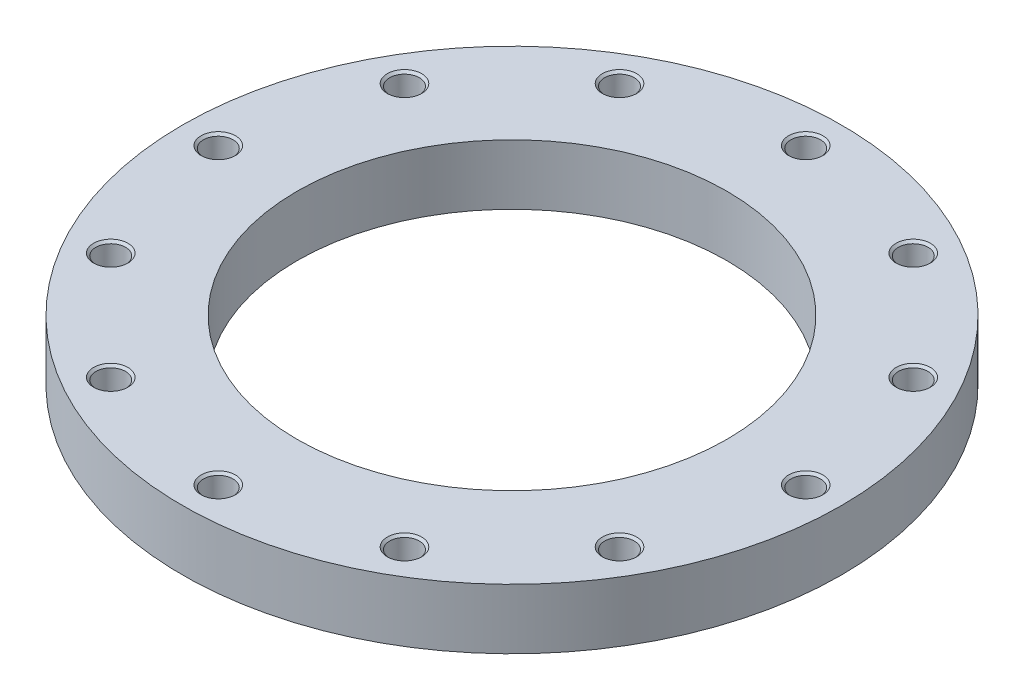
ISO-10303-21;
HEADER;
FILE_DESCRIPTION(('STEP AP214'),'2;1');
FILE_NAME('part.step','',(''),(''),'','','');
FILE_SCHEMA(('AUTOMOTIVE_DESIGN { 1 0 10303 214 1 1 1 1 }'));
ENDSEC;
DATA;
#1=APPLICATION_CONTEXT('core data for automotive mechanical design processes');
#2=APPLICATION_PROTOCOL_DEFINITION('international standard','automotive_design',2000,#1);
#3=PRODUCT_CONTEXT('',#1,'mechanical');
#4=PRODUCT('Part','Part','',(#3));
#5=PRODUCT_RELATED_PRODUCT_CATEGORY('part','',(#4));
#6=PRODUCT_DEFINITION_FORMATION('','',#4);
#7=PRODUCT_DEFINITION_CONTEXT('part definition',#1,'design');
#8=PRODUCT_DEFINITION('design','',#6,#7);
#9=PRODUCT_DEFINITION_SHAPE('','',#8);
#10=(LENGTH_UNIT() NAMED_UNIT(*) SI_UNIT(.MILLI.,.METRE.));
#11=(NAMED_UNIT(*) PLANE_ANGLE_UNIT() SI_UNIT($,.RADIAN.));
#12=(NAMED_UNIT(*) SI_UNIT($,.STERADIAN.) SOLID_ANGLE_UNIT());
#13=UNCERTAINTY_MEASURE_WITH_UNIT(LENGTH_MEASURE(1.E-05),#10,'distance_accuracy_value','');
#14=(GEOMETRIC_REPRESENTATION_CONTEXT(3) GLOBAL_UNCERTAINTY_ASSIGNED_CONTEXT((#13)) GLOBAL_UNIT_ASSIGNED_CONTEXT((#10,
#11,#12)) REPRESENTATION_CONTEXT('',''));
#15=CARTESIAN_POINT('',(0.,0.,0.));
#16=DIRECTION('',(0.,0.,1.));
#17=DIRECTION('',(1.,0.,0.));
#18=AXIS2_PLACEMENT_3D('',#15,#16,#17);
#19=CARTESIAN_POINT('',(0.,21.,0.));
#20=DIRECTION('',(0.,-1.,0.));
#21=DIRECTION('',(1.,0.,0.));
#22=AXIS2_PLACEMENT_3D('',#19,#20,#21);
#23=CYLINDRICAL_SURFACE('',#22,230.);
#24=CARTESIAN_POINT('',(0.,0.,0.));
#25=DIRECTION('',(0.,1.,0.));
#26=DIRECTION('',(1.,0.,0.));
#27=AXIS2_PLACEMENT_3D('',#24,#25,#26);
#28=CIRCLE('',#27,230.);
#29=CARTESIAN_POINT('',(230.,0.,0.));
#30=VERTEX_POINT('',#29);
#31=EDGE_CURVE('E9',#30,#30,#28,.T.);
#32=ORIENTED_EDGE('',*,*,#31,.T.);
#33=EDGE_LOOP('',(#32));
#34=FACE_BOUND('',#33,.T.);
#35=CARTESIAN_POINT('',(0.,42.,0.));
#36=DIRECTION('',(0.,1.,0.));
#37=DIRECTION('',(1.,0.,0.));
#38=AXIS2_PLACEMENT_3D('',#35,#36,#37);
#39=CIRCLE('',#38,230.);
#40=CARTESIAN_POINT('',(230.,42.,0.));
#41=VERTEX_POINT('',#40);
#42=EDGE_CURVE('E186',#41,#41,#39,.T.);
#43=ORIENTED_EDGE('',*,*,#42,.F.);
#44=EDGE_LOOP('',(#43));
#45=FACE_BOUND('',#44,.T.);
#46=ADVANCED_FACE('F15',(#34,#45),#23,.T.);
#47=CARTESIAN_POINT('',(190.,0.,0.));
#48=DIRECTION('',(0.,-1.,0.));
#49=DIRECTION('',(-1.,0.,0.));
#50=AXIS2_PLACEMENT_3D('',#47,#48,#49);
#51=PLANE('',#50);
#52=CARTESIAN_POINT('',(0.,0.,0.));
#53=DIRECTION('',(0.,1.,0.));
#54=DIRECTION('',(1.,0.,0.));
#55=AXIS2_PLACEMENT_3D('',#52,#53,#54);
#56=CIRCLE('',#55,150.);
#57=CARTESIAN_POINT('',(150.,0.,0.));
#58=VERTEX_POINT('',#57);
#59=EDGE_CURVE('E23',#58,#58,#56,.T.);
#60=ORIENTED_EDGE('',*,*,#59,.T.);
#61=EDGE_LOOP('',(#60));
#62=FACE_BOUND('',#61,.T.);
#63=ORIENTED_EDGE('',*,*,#31,.F.);
#64=EDGE_LOOP('',(#63));
#65=FACE_BOUND('',#64,.T.);
#66=ADVANCED_FACE('F415',(#62,#65),#51,.T.);
#67=CARTESIAN_POINT('',(0.,21.,0.));
#68=DIRECTION('',(0.,-1.,0.));
#69=DIRECTION('',(1.,0.,0.));
#70=AXIS2_PLACEMENT_3D('',#67,#68,#69);
#71=CYLINDRICAL_SURFACE('',#70,150.);
#72=CARTESIAN_POINT('',(0.,42.,0.));
#73=DIRECTION('',(0.,1.,0.));
#74=DIRECTION('',(1.,0.,0.));
#75=AXIS2_PLACEMENT_3D('',#72,#73,#74);
#76=CIRCLE('',#75,150.);
#77=CARTESIAN_POINT('',(150.,42.,0.));
#78=VERTEX_POINT('',#77);
#79=EDGE_CURVE('E181',#78,#78,#76,.T.);
#80=ORIENTED_EDGE('',*,*,#79,.T.);
#81=EDGE_LOOP('',(#80));
#82=FACE_BOUND('',#81,.T.);
#83=ORIENTED_EDGE('',*,*,#59,.F.);
#84=EDGE_LOOP('',(#83));
#85=FACE_BOUND('',#84,.T.);
#86=ADVANCED_FACE('F419',(#82,#85),#71,.F.);
#87=CARTESIAN_POINT('',(190.,42.,0.));
#88=DIRECTION('',(0.,1.,0.));
#89=DIRECTION('',(1.,0.,0.));
#90=AXIS2_PLACEMENT_3D('',#87,#88,#89);
#91=PLANE('',#90);
#92=ORIENTED_EDGE('',*,*,#42,.T.);
#93=EDGE_LOOP('',(#92));
#94=FACE_BOUND('',#93,.T.);
#95=ORIENTED_EDGE('',*,*,#79,.F.);
#96=EDGE_LOOP('',(#95));
#97=FACE_BOUND('',#96,.T.);
#98=CARTESIAN_POINT('',(205.,42.,0.));
#99=DIRECTION('',(0.,-1.,0.));
#100=DIRECTION('',(1.,0.,0.));
#101=AXIS2_PLACEMENT_3D('',#98,#99,#100);
#102=CIRCLE('',#101,12.);
#103=CARTESIAN_POINT('',(217.,42.,0.));
#104=VERTEX_POINT('',#103);
#105=EDGE_CURVE('E297',#104,#104,#102,.T.);
#106=ORIENTED_EDGE('',*,*,#105,.T.);
#107=EDGE_LOOP('',(#106));
#108=FACE_BOUND('',#107,.T.);
#109=CARTESIAN_POINT('',(177.53520777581,42.,-102.5));
#110=DIRECTION('',(0.,-1.,0.));
#111=DIRECTION('',(0.866025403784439,0.,-0.5));
#112=AXIS2_PLACEMENT_3D('',#109,#110,#111);
#113=CIRCLE('',#112,12.);
#114=CARTESIAN_POINT('',(187.927512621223,42.,-108.5));
#115=VERTEX_POINT('',#114);
#116=EDGE_CURVE('E280',#115,#115,#113,.T.);
#117=ORIENTED_EDGE('',*,*,#116,.T.);
#118=EDGE_LOOP('',(#117));
#119=FACE_BOUND('',#118,.T.);
#120=CARTESIAN_POINT('',(102.5,42.,-177.53520777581));
#121=DIRECTION('',(0.,-1.,0.));
#122=DIRECTION('',(0.5,0.,-0.866025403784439));
#123=AXIS2_PLACEMENT_3D('',#120,#121,#122);
#124=CIRCLE('',#123,12.);
#125=CARTESIAN_POINT('',(108.5,42.,-187.927512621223));
#126=VERTEX_POINT('',#125);
#127=EDGE_CURVE('E311',#126,#126,#124,.T.);
#128=ORIENTED_EDGE('',*,*,#127,.T.);
#129=EDGE_LOOP('',(#128));
#130=FACE_BOUND('',#129,.T.);
#131=CARTESIAN_POINT('',(0.,42.,-205.));
#132=DIRECTION('',(0.,-1.,0.));
#133=DIRECTION('',(0.,0.,-1.));
#134=AXIS2_PLACEMENT_3D('',#131,#132,#133);
#135=CIRCLE('',#134,12.);
#136=CARTESIAN_POINT('',(0.,42.,-217.));
#137=VERTEX_POINT('',#136);
#138=EDGE_CURVE('E392',#137,#137,#135,.T.);
#139=ORIENTED_EDGE('',*,*,#138,.T.);
#140=EDGE_LOOP('',(#139));
#141=FACE_BOUND('',#140,.T.);
#142=CARTESIAN_POINT('',(-102.5,42.,-177.53520777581));
#143=DIRECTION('',(0.,-1.,0.));
#144=DIRECTION('',(-0.5,0.,-0.866025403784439));
#145=AXIS2_PLACEMENT_3D('',#142,#143,#144);
#146=CIRCLE('',#145,12.);
#147=CARTESIAN_POINT('',(-108.5,42.,-187.927512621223));
#148=VERTEX_POINT('',#147);
#149=EDGE_CURVE('E379',#148,#148,#146,.T.);
#150=ORIENTED_EDGE('',*,*,#149,.T.);
#151=EDGE_LOOP('',(#150));
#152=FACE_BOUND('',#151,.T.);
#153=CARTESIAN_POINT('',(-177.53520777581,42.,-102.5));
#154=DIRECTION('',(0.,-1.,0.));
#155=DIRECTION('',(-0.866025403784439,0.,-0.5));
#156=AXIS2_PLACEMENT_3D('',#153,#154,#155);
#157=CIRCLE('',#156,12.);
#158=CARTESIAN_POINT('',(-187.927512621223,42.,-108.5));
#159=VERTEX_POINT('',#158);
#160=EDGE_CURVE('E372',#159,#159,#157,.T.);
#161=ORIENTED_EDGE('',*,*,#160,.T.);
#162=EDGE_LOOP('',(#161));
#163=FACE_BOUND('',#162,.T.);
#164=CARTESIAN_POINT('',(-205.,42.,0.));
#165=DIRECTION('',(0.,-1.,0.));
#166=DIRECTION('',(-1.,0.,0.));
#167=AXIS2_PLACEMENT_3D('',#164,#165,#166);
#168=CIRCLE('',#167,12.);
#169=CARTESIAN_POINT('',(-217.,42.,0.));
#170=VERTEX_POINT('',#169);
#171=EDGE_CURVE('E358',#170,#170,#168,.T.);
#172=ORIENTED_EDGE('',*,*,#171,.T.);
#173=EDGE_LOOP('',(#172));
#174=FACE_BOUND('',#173,.T.);
#175=CARTESIAN_POINT('',(-177.53520777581,42.,102.5));
#176=DIRECTION('',(0.,-1.,0.));
#177=DIRECTION('',(-0.866025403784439,0.,0.5));
#178=AXIS2_PLACEMENT_3D('',#175,#176,#177);
#179=CIRCLE('',#178,12.);
#180=CARTESIAN_POINT('',(-187.927512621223,42.,108.5));
#181=VERTEX_POINT('',#180);
#182=EDGE_CURVE('E350',#181,#181,#179,.T.);
#183=ORIENTED_EDGE('',*,*,#182,.T.);
#184=EDGE_LOOP('',(#183));
#185=FACE_BOUND('',#184,.T.);
#186=CARTESIAN_POINT('',(-102.5,42.,177.53520777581));
#187=DIRECTION('',(0.,-1.,0.));
#188=DIRECTION('',(-0.5,0.,0.866025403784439));
#189=AXIS2_PLACEMENT_3D('',#186,#187,#188);
#190=CIRCLE('',#189,12.);
#191=CARTESIAN_POINT('',(-108.5,42.,187.927512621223));
#192=VERTEX_POINT('',#191);
#193=EDGE_CURVE('E328',#192,#192,#190,.T.);
#194=ORIENTED_EDGE('',*,*,#193,.T.);
#195=EDGE_LOOP('',(#194));
#196=FACE_BOUND('',#195,.T.);
#197=CARTESIAN_POINT('',(0.,42.,205.));
#198=DIRECTION('',(0.,-1.,0.));
#199=DIRECTION('',(0.,0.,1.));
#200=AXIS2_PLACEMENT_3D('',#197,#198,#199);
#201=CIRCLE('',#200,12.);
#202=CARTESIAN_POINT('',(0.,42.,217.));
#203=VERTEX_POINT('',#202);
#204=EDGE_CURVE('E1069',#203,#203,#201,.T.);
#205=ORIENTED_EDGE('',*,*,#204,.T.);
#206=EDGE_LOOP('',(#205));
#207=FACE_BOUND('',#206,.T.);
#208=CARTESIAN_POINT('',(102.5,42.,177.53520777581));
#209=DIRECTION('',(0.,-1.,0.));
#210=DIRECTION('',(0.5,0.,0.866025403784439));
#211=AXIS2_PLACEMENT_3D('',#208,#209,#210);
#212=CIRCLE('',#211,12.);
#213=CARTESIAN_POINT('',(108.5,42.,187.927512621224));
#214=VERTEX_POINT('',#213);
#215=EDGE_CURVE('E1055',#214,#214,#212,.T.);
#216=ORIENTED_EDGE('',*,*,#215,.T.);
#217=EDGE_LOOP('',(#216));
#218=FACE_BOUND('',#217,.T.);
#219=CARTESIAN_POINT('',(177.53520777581,42.,102.5));
#220=DIRECTION('',(0.,-1.,0.));
#221=DIRECTION('',(0.866025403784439,0.,0.5));
#222=AXIS2_PLACEMENT_3D('',#219,#220,#221);
#223=CIRCLE('',#222,12.);
#224=CARTESIAN_POINT('',(187.927512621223,42.,108.5));
#225=VERTEX_POINT('',#224);
#226=EDGE_CURVE('E1064',#225,#225,#223,.T.);
#227=ORIENTED_EDGE('',*,*,#226,.T.);
#228=EDGE_LOOP('',(#227));
#229=FACE_BOUND('',#228,.T.);
#230=ADVANCED_FACE('F281',(#94,#97,#108,#119,#130,#141,#152,#163,#174,#185,#196,#207,#218,#229),
#91,.T.);
#231=CARTESIAN_POINT('',(205.,6.00463463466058,0.));
#232=DIRECTION('',(0.,1.,0.));
#233=DIRECTION('',(1.,0.,0.));
#234=AXIS2_PLACEMENT_3D('',#231,#232,#233);
#235=CONICAL_SURFACE('',#234,5.188125,1.0471975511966);
#236=CARTESIAN_POINT('',(205.,9.,0.));
#237=DIRECTION('',(0.,-1.,0.));
#238=DIRECTION('',(1.,0.,0.));
#239=AXIS2_PLACEMENT_3D('',#236,#237,#238);
#240=CIRCLE('',#239,10.37625);
#241=CARTESIAN_POINT('',(215.37625,9.,0.));
#242=VERTEX_POINT('',#241);
#243=EDGE_CURVE('E303',#242,#242,#240,.T.);
#244=ORIENTED_EDGE('',*,*,#243,.F.);
#245=EDGE_LOOP('',(#244));
#246=FACE_BOUND('',#245,.T.);
#247=CARTESIAN_POINT('',(205.,3.00926926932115,0.));
#248=VERTEX_POINT('',#247);
#249=VERTEX_LOOP('',#248);
#250=FACE_BOUND('',#249,.T.);
#251=ADVANCED_FACE('F429',(#246,#250),#235,.F.);
#252=CARTESIAN_POINT('',(205.,12.688125,0.));
#253=DIRECTION('',(0.,1.,0.));
#254=DIRECTION('',(1.,0.,0.));
#255=AXIS2_PLACEMENT_3D('',#252,#253,#254);
#256=CYLINDRICAL_SURFACE('',#255,10.37625);
#257=CARTESIAN_POINT('',(205.,16.37625,0.));
#258=DIRECTION('',(0.,-1.,0.));
#259=DIRECTION('',(1.,0.,0.));
#260=AXIS2_PLACEMENT_3D('',#257,#258,#259);
#261=CIRCLE('',#260,10.37625);
#262=CARTESIAN_POINT('',(215.37625,16.37625,0.));
#263=VERTEX_POINT('',#262);
#264=EDGE_CURVE('E305',#263,#263,#261,.T.);
#265=ORIENTED_EDGE('',*,*,#264,.F.);
#266=EDGE_LOOP('',(#265));
#267=FACE_BOUND('',#266,.T.);
#268=ORIENTED_EDGE('',*,*,#243,.T.);
#269=EDGE_LOOP('',(#268));
#270=FACE_BOUND('',#269,.T.);
#271=ADVANCED_FACE('F432',(#267,#270),#256,.F.);
#272=CARTESIAN_POINT('',(205.,17.188125,0.));
#273=DIRECTION('',(0.,1.,0.));
#274=DIRECTION('',(1.,0.,0.));
#275=AXIS2_PLACEMENT_3D('',#272,#273,#274);
#276=CONICAL_SURFACE('',#275,11.188125,0.785398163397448);
#277=CARTESIAN_POINT('',(205.,18.,0.));
#278=DIRECTION('',(0.,-1.,0.));
#279=DIRECTION('',(1.,0.,0.));
#280=AXIS2_PLACEMENT_3D('',#277,#278,#279);
#281=CIRCLE('',#280,12.);
#282=CARTESIAN_POINT('',(217.,18.,0.));
#283=VERTEX_POINT('',#282);
#284=EDGE_CURVE('E302',#283,#283,#281,.T.);
#285=ORIENTED_EDGE('',*,*,#284,.F.);
#286=EDGE_LOOP('',(#285));
#287=FACE_BOUND('',#286,.T.);
#288=ORIENTED_EDGE('',*,*,#264,.T.);
#289=EDGE_LOOP('',(#288));
#290=FACE_BOUND('',#289,.T.);
#291=ADVANCED_FACE('F1018',(#287,#290),#276,.F.);
#292=CARTESIAN_POINT('',(216.188125,18.,0.));
#293=DIRECTION('',(0.,1.,0.));
#294=DIRECTION('',(-1.,0.,0.));
#295=AXIS2_PLACEMENT_3D('',#292,#293,#294);
#296=PLANE('',#295);
#297=CARTESIAN_POINT('',(205.,18.,0.));
#298=DIRECTION('',(0.,-1.,0.));
#299=DIRECTION('',(1.,0.,0.));
#300=AXIS2_PLACEMENT_3D('',#297,#298,#299);
#301=CIRCLE('',#300,10.37625);
#302=CARTESIAN_POINT('',(215.37625,18.,0.));
#303=VERTEX_POINT('',#302);
#304=EDGE_CURVE('E300',#303,#303,#301,.T.);
#305=ORIENTED_EDGE('',*,*,#304,.F.);
#306=EDGE_LOOP('',(#305));
#307=FACE_BOUND('',#306,.T.);
#308=ORIENTED_EDGE('',*,*,#284,.T.);
#309=EDGE_LOOP('',(#308));
#310=FACE_BOUND('',#309,.T.);
#311=ADVANCED_FACE('F438',(#307,#310),#296,.F.);
#312=CARTESIAN_POINT('',(205.,29.188125,0.));
#313=DIRECTION('',(0.,1.,0.));
#314=DIRECTION('',(1.,0.,0.));
#315=AXIS2_PLACEMENT_3D('',#312,#313,#314);
#316=CYLINDRICAL_SURFACE('',#315,10.37625);
#317=CARTESIAN_POINT('',(205.,40.37625,0.));
#318=DIRECTION('',(0.,-1.,0.));
#319=DIRECTION('',(1.,0.,0.));
#320=AXIS2_PLACEMENT_3D('',#317,#318,#319);
#321=CIRCLE('',#320,10.37625);
#322=CARTESIAN_POINT('',(215.37625,40.37625,0.));
#323=VERTEX_POINT('',#322);
#324=EDGE_CURVE('E295',#323,#323,#321,.T.);
#325=ORIENTED_EDGE('',*,*,#324,.F.);
#326=EDGE_LOOP('',(#325));
#327=FACE_BOUND('',#326,.T.);
#328=ORIENTED_EDGE('',*,*,#304,.T.);
#329=EDGE_LOOP('',(#328));
#330=FACE_BOUND('',#329,.T.);
#331=ADVANCED_FACE('F434',(#327,#330),#316,.F.);
#332=CARTESIAN_POINT('',(205.,41.188125,0.));
#333=DIRECTION('',(0.,1.,0.));
#334=DIRECTION('',(1.,0.,0.));
#335=AXIS2_PLACEMENT_3D('',#332,#333,#334);
#336=CONICAL_SURFACE('',#335,11.188125,0.785398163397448);
#337=ORIENTED_EDGE('',*,*,#105,.F.);
#338=EDGE_LOOP('',(#337));
#339=FACE_BOUND('',#338,.T.);
#340=ORIENTED_EDGE('',*,*,#324,.T.);
#341=EDGE_LOOP('',(#340));
#342=FACE_BOUND('',#341,.T.);
#343=ADVANCED_FACE('F437',(#339,#342),#336,.F.);
#344=CARTESIAN_POINT('',(177.53520777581,6.00463463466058,-102.5));
#345=DIRECTION('',(0.,1.,0.));
#346=DIRECTION('',(0.866025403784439,0.,-0.5));
#347=AXIS2_PLACEMENT_3D('',#344,#345,#346);
#348=CONICAL_SURFACE('',#347,5.188125,1.0471975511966);
#349=CARTESIAN_POINT('',(177.53520777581,9.,-102.5));
#350=DIRECTION('',(0.,-1.,0.));
#351=DIRECTION('',(0.866025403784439,0.,-0.5));
#352=AXIS2_PLACEMENT_3D('',#349,#350,#351);
#353=CIRCLE('',#352,10.37625);
#354=CARTESIAN_POINT('',(186.521303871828,9.,-107.688125));
#355=VERTEX_POINT('',#354);
#356=EDGE_CURVE('E298',#355,#355,#353,.T.);
#357=ORIENTED_EDGE('',*,*,#356,.F.);
#358=EDGE_LOOP('',(#357));
#359=FACE_BOUND('',#358,.T.);
#360=CARTESIAN_POINT('',(177.53520777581,3.00926926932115,-102.5));
#361=VERTEX_POINT('',#360);
#362=VERTEX_LOOP('',#361);
#363=FACE_BOUND('',#362,.T.);
#364=ADVANCED_FACE('F1022',(#359,#363),#348,.F.);
#365=CARTESIAN_POINT('',(177.53520777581,12.688125,-102.5));
#366=DIRECTION('',(0.,1.,0.));
#367=DIRECTION('',(0.866025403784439,0.,-0.5));
#368=AXIS2_PLACEMENT_3D('',#365,#366,#367);
#369=CYLINDRICAL_SURFACE('',#368,10.37625);
#370=CARTESIAN_POINT('',(177.53520777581,16.37625,-102.5));
#371=DIRECTION('',(0.,-1.,0.));
#372=DIRECTION('',(0.866025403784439,0.,-0.5));
#373=AXIS2_PLACEMENT_3D('',#370,#371,#372);
#374=CIRCLE('',#373,10.37625);
#375=CARTESIAN_POINT('',(186.521303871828,16.37625,-107.688125));
#376=VERTEX_POINT('',#375);
#377=EDGE_CURVE('E384',#376,#376,#374,.T.);
#378=ORIENTED_EDGE('',*,*,#377,.F.);
#379=EDGE_LOOP('',(#378));
#380=FACE_BOUND('',#379,.T.);
#381=ORIENTED_EDGE('',*,*,#356,.T.);
#382=EDGE_LOOP('',(#381));
#383=FACE_BOUND('',#382,.T.);
#384=ADVANCED_FACE('F444',(#380,#383),#369,.F.);
#385=CARTESIAN_POINT('',(177.53520777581,17.188125,-102.5));
#386=DIRECTION('',(0.,1.,0.));
#387=DIRECTION('',(0.866025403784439,0.,-0.5));
#388=AXIS2_PLACEMENT_3D('',#385,#386,#387);
#389=CONICAL_SURFACE('',#388,11.188125,0.785398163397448);
#390=CARTESIAN_POINT('',(177.53520777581,18.,-102.5));
#391=DIRECTION('',(0.,-1.,0.));
#392=DIRECTION('',(0.866025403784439,0.,-0.5));
#393=AXIS2_PLACEMENT_3D('',#390,#391,#392);
#394=CIRCLE('',#393,12.);
#395=CARTESIAN_POINT('',(187.927512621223,18.,-108.5));
#396=VERTEX_POINT('',#395);
#397=EDGE_CURVE('E287',#396,#396,#394,.T.);
#398=ORIENTED_EDGE('',*,*,#397,.F.);
#399=EDGE_LOOP('',(#398));
#400=FACE_BOUND('',#399,.T.);
#401=ORIENTED_EDGE('',*,*,#377,.T.);
#402=EDGE_LOOP('',(#401));
#403=FACE_BOUND('',#402,.T.);
#404=ADVANCED_FACE('F440',(#400,#403),#389,.F.);
#405=CARTESIAN_POINT('',(187.224408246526,18.,-108.0940625));
#406=DIRECTION('',(0.,1.,0.));
#407=DIRECTION('',(-0.866025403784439,0.,0.5));
#408=AXIS2_PLACEMENT_3D('',#405,#406,#407);
#409=PLANE('',#408);
#410=CARTESIAN_POINT('',(177.53520777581,18.,-102.5));
#411=DIRECTION('',(0.,-1.,0.));
#412=DIRECTION('',(0.866025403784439,0.,-0.5));
#413=AXIS2_PLACEMENT_3D('',#410,#411,#412);
#414=CIRCLE('',#413,10.37625);
#415=CARTESIAN_POINT('',(186.521303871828,18.,-107.688125));
#416=VERTEX_POINT('',#415);
#417=EDGE_CURVE('E284',#416,#416,#414,.T.);
#418=ORIENTED_EDGE('',*,*,#417,.F.);
#419=EDGE_LOOP('',(#418));
#420=FACE_BOUND('',#419,.T.);
#421=ORIENTED_EDGE('',*,*,#397,.T.);
#422=EDGE_LOOP('',(#421));
#423=FACE_BOUND('',#422,.T.);
#424=ADVANCED_FACE('F443',(#420,#423),#409,.F.);
#425=CARTESIAN_POINT('',(177.53520777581,29.188125,-102.5));
#426=DIRECTION('',(0.,1.,0.));
#427=DIRECTION('',(0.866025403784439,0.,-0.5));
#428=AXIS2_PLACEMENT_3D('',#425,#426,#427);
#429=CYLINDRICAL_SURFACE('',#428,10.37625);
#430=CARTESIAN_POINT('',(177.53520777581,40.37625,-102.5));
#431=DIRECTION('',(0.,-1.,0.));
#432=DIRECTION('',(0.866025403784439,0.,-0.5));
#433=AXIS2_PLACEMENT_3D('',#430,#431,#432);
#434=CIRCLE('',#433,10.37625);
#435=CARTESIAN_POINT('',(186.521303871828,40.37625,-107.688125));
#436=VERTEX_POINT('',#435);
#437=EDGE_CURVE('E285',#436,#436,#434,.T.);
#438=ORIENTED_EDGE('',*,*,#437,.F.);
#439=EDGE_LOOP('',(#438));
#440=FACE_BOUND('',#439,.T.);
#441=ORIENTED_EDGE('',*,*,#417,.T.);
#442=EDGE_LOOP('',(#441));
#443=FACE_BOUND('',#442,.T.);
#444=ADVANCED_FACE('F448',(#440,#443),#429,.F.);
#445=CARTESIAN_POINT('',(177.53520777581,41.188125,-102.5));
#446=DIRECTION('',(0.,1.,0.));
#447=DIRECTION('',(0.866025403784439,0.,-0.5));
#448=AXIS2_PLACEMENT_3D('',#445,#446,#447);
#449=CONICAL_SURFACE('',#448,11.188125,0.785398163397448);
#450=ORIENTED_EDGE('',*,*,#116,.F.);
#451=EDGE_LOOP('',(#450));
#452=FACE_BOUND('',#451,.T.);
#453=ORIENTED_EDGE('',*,*,#437,.T.);
#454=EDGE_LOOP('',(#453));
#455=FACE_BOUND('',#454,.T.);
#456=ADVANCED_FACE('F1026',(#452,#455),#449,.F.);
#457=CARTESIAN_POINT('',(102.5,6.00463463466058,-177.53520777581));
#458=DIRECTION('',(0.,1.,0.));
#459=DIRECTION('',(0.5,0.,-0.866025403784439));
#460=AXIS2_PLACEMENT_3D('',#457,#458,#459);
#461=CONICAL_SURFACE('',#460,5.188125,1.0471975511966);
#462=CARTESIAN_POINT('',(102.5,9.,-177.53520777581));
#463=DIRECTION('',(0.,-1.,0.));
#464=DIRECTION('',(0.5,0.,-0.866025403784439));
#465=AXIS2_PLACEMENT_3D('',#462,#463,#464);
#466=CIRCLE('',#465,10.37625);
#467=CARTESIAN_POINT('',(107.688125,9.,-186.521303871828));
#468=VERTEX_POINT('',#467);
#469=EDGE_CURVE('E289',#468,#468,#466,.T.);
#470=ORIENTED_EDGE('',*,*,#469,.F.);
#471=EDGE_LOOP('',(#470));
#472=FACE_BOUND('',#471,.T.);
#473=CARTESIAN_POINT('',(102.5,3.00926926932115,-177.53520777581));
#474=VERTEX_POINT('',#473);
#475=VERTEX_LOOP('',#474);
#476=FACE_BOUND('',#475,.T.);
#477=ADVANCED_FACE('F1039',(#472,#476),#461,.F.);
#478=CARTESIAN_POINT('',(102.5,12.688125,-177.53520777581));
#479=DIRECTION('',(0.,1.,0.));
#480=DIRECTION('',(0.5,0.,-0.866025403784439));
#481=AXIS2_PLACEMENT_3D('',#478,#479,#480);
#482=CYLINDRICAL_SURFACE('',#481,10.37625);
#483=CARTESIAN_POINT('',(102.5,16.37625,-177.53520777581));
#484=DIRECTION('',(0.,-1.,0.));
#485=DIRECTION('',(0.5,0.,-0.866025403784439));
#486=AXIS2_PLACEMENT_3D('',#483,#484,#485);
#487=CIRCLE('',#486,10.37625);
#488=CARTESIAN_POINT('',(107.688125,16.37625,-186.521303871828));
#489=VERTEX_POINT('',#488);
#490=EDGE_CURVE('E293',#489,#489,#487,.T.);
#491=ORIENTED_EDGE('',*,*,#490,.F.);
#492=EDGE_LOOP('',(#491));
#493=FACE_BOUND('',#492,.T.);
#494=ORIENTED_EDGE('',*,*,#469,.T.);
#495=EDGE_LOOP('',(#494));
#496=FACE_BOUND('',#495,.T.);
#497=ADVANCED_FACE('F454',(#493,#496),#482,.F.);
#498=CARTESIAN_POINT('',(102.5,17.188125,-177.53520777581));
#499=DIRECTION('',(0.,1.,0.));
#500=DIRECTION('',(0.5,0.,-0.866025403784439));
#501=AXIS2_PLACEMENT_3D('',#498,#499,#500);
#502=CONICAL_SURFACE('',#501,11.188125,0.785398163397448);
#503=CARTESIAN_POINT('',(102.5,18.,-177.53520777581));
#504=DIRECTION('',(0.,-1.,0.));
#505=DIRECTION('',(0.5,0.,-0.866025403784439));
#506=AXIS2_PLACEMENT_3D('',#503,#504,#505);
#507=CIRCLE('',#506,12.);
#508=CARTESIAN_POINT('',(108.5,18.,-187.927512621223));
#509=VERTEX_POINT('',#508);
#510=EDGE_CURVE('E314',#509,#509,#507,.T.);
#511=ORIENTED_EDGE('',*,*,#510,.F.);
#512=EDGE_LOOP('',(#511));
#513=FACE_BOUND('',#512,.T.);
#514=ORIENTED_EDGE('',*,*,#490,.T.);
#515=EDGE_LOOP('',(#514));
#516=FACE_BOUND('',#515,.T.);
#517=ADVANCED_FACE('F450',(#513,#516),#502,.F.);
#518=CARTESIAN_POINT('',(108.0940625,18.,-187.224408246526));
#519=DIRECTION('',(0.,1.,0.));
#520=DIRECTION('',(-0.5,0.,0.866025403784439));
#521=AXIS2_PLACEMENT_3D('',#518,#519,#520);
#522=PLANE('',#521);
#523=CARTESIAN_POINT('',(102.5,18.,-177.53520777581));
#524=DIRECTION('',(0.,-1.,0.));
#525=DIRECTION('',(0.5,0.,-0.866025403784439));
#526=AXIS2_PLACEMENT_3D('',#523,#524,#525);
#527=CIRCLE('',#526,10.37625);
#528=CARTESIAN_POINT('',(107.688125,18.,-186.521303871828));
#529=VERTEX_POINT('',#528);
#530=EDGE_CURVE('E313',#529,#529,#527,.T.);
#531=ORIENTED_EDGE('',*,*,#530,.F.);
#532=EDGE_LOOP('',(#531));
#533=FACE_BOUND('',#532,.T.);
#534=ORIENTED_EDGE('',*,*,#510,.T.);
#535=EDGE_LOOP('',(#534));
#536=FACE_BOUND('',#535,.T.);
#537=ADVANCED_FACE('F453',(#533,#536),#522,.F.);
#538=CARTESIAN_POINT('',(102.5,29.188125,-177.53520777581));
#539=DIRECTION('',(0.,1.,0.));
#540=DIRECTION('',(0.5,0.,-0.866025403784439));
#541=AXIS2_PLACEMENT_3D('',#538,#539,#540);
#542=CYLINDRICAL_SURFACE('',#541,10.37625);
#543=CARTESIAN_POINT('',(102.5,40.37625,-177.53520777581));
#544=DIRECTION('',(0.,-1.,0.));
#545=DIRECTION('',(0.5,0.,-0.866025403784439));
#546=AXIS2_PLACEMENT_3D('',#543,#544,#545);
#547=CIRCLE('',#546,10.37625);
#548=CARTESIAN_POINT('',(107.688125,40.37625,-186.521303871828));
#549=VERTEX_POINT('',#548);
#550=EDGE_CURVE('E340',#549,#549,#547,.T.);
#551=ORIENTED_EDGE('',*,*,#550,.F.);
#552=EDGE_LOOP('',(#551));
#553=FACE_BOUND('',#552,.T.);
#554=ORIENTED_EDGE('',*,*,#530,.T.);
#555=EDGE_LOOP('',(#554));
#556=FACE_BOUND('',#555,.T.);
#557=ADVANCED_FACE('F411',(#553,#556),#542,.F.);
#558=CARTESIAN_POINT('',(102.5,41.188125,-177.53520777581));
#559=DIRECTION('',(0.,1.,0.));
#560=DIRECTION('',(0.5,0.,-0.866025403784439));
#561=AXIS2_PLACEMENT_3D('',#558,#559,#560);
#562=CONICAL_SURFACE('',#561,11.188125,0.785398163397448);
#563=ORIENTED_EDGE('',*,*,#127,.F.);
#564=EDGE_LOOP('',(#563));
#565=FACE_BOUND('',#564,.T.);
#566=ORIENTED_EDGE('',*,*,#550,.T.);
#567=EDGE_LOOP('',(#566));
#568=FACE_BOUND('',#567,.T.);
#569=ADVANCED_FACE('F401',(#565,#568),#562,.F.);
#570=CARTESIAN_POINT('',(0.,6.00463463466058,-205.));
#571=DIRECTION('',(0.,1.,0.));
#572=DIRECTION('',(0.,0.,-1.));
#573=AXIS2_PLACEMENT_3D('',#570,#571,#572);
#574=CONICAL_SURFACE('',#573,5.188125,1.0471975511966);
#575=CARTESIAN_POINT('',(0.,9.,-205.));
#576=DIRECTION('',(0.,-1.,0.));
#577=DIRECTION('',(0.,0.,-1.));
#578=AXIS2_PLACEMENT_3D('',#575,#576,#577);
#579=CIRCLE('',#578,10.37625);
#580=CARTESIAN_POINT('',(0.,9.,-215.37625));
#581=VERTEX_POINT('',#580);
#582=EDGE_CURVE('E342',#581,#581,#579,.T.);
#583=ORIENTED_EDGE('',*,*,#582,.F.);
#584=EDGE_LOOP('',(#583));
#585=FACE_BOUND('',#584,.T.);
#586=CARTESIAN_POINT('',(0.,3.00926926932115,-205.));
#587=VERTEX_POINT('',#586);
#588=VERTEX_LOOP('',#587);
#589=FACE_BOUND('',#588,.T.);
#590=ADVANCED_FACE('F398',(#585,#589),#574,.F.);
#591=CARTESIAN_POINT('',(0.,12.688125,-205.));
#592=DIRECTION('',(0.,1.,0.));
#593=DIRECTION('',(0.,0.,-1.));
#594=AXIS2_PLACEMENT_3D('',#591,#592,#593);
#595=CYLINDRICAL_SURFACE('',#594,10.37625);
#596=CARTESIAN_POINT('',(0.,16.37625,-205.));
#597=DIRECTION('',(0.,-1.,0.));
#598=DIRECTION('',(0.,0.,-1.));
#599=AXIS2_PLACEMENT_3D('',#596,#597,#598);
#600=CIRCLE('',#599,10.37625);
#601=CARTESIAN_POINT('',(0.,16.37625,-215.37625));
#602=VERTEX_POINT('',#601);
#603=EDGE_CURVE('E336',#602,#602,#600,.T.);
#604=ORIENTED_EDGE('',*,*,#603,.F.);
#605=EDGE_LOOP('',(#604));
#606=FACE_BOUND('',#605,.T.);
#607=ORIENTED_EDGE('',*,*,#582,.T.);
#608=EDGE_LOOP('',(#607));
#609=FACE_BOUND('',#608,.T.);
#610=ADVANCED_FACE('F396',(#606,#609),#595,.F.);
#611=CARTESIAN_POINT('',(0.,17.188125,-205.));
#612=DIRECTION('',(0.,1.,0.));
#613=DIRECTION('',(0.,0.,-1.));
#614=AXIS2_PLACEMENT_3D('',#611,#612,#613);
#615=CONICAL_SURFACE('',#614,11.188125,0.785398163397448);
#616=CARTESIAN_POINT('',(0.,18.,-205.));
#617=DIRECTION('',(0.,-1.,0.));
#618=DIRECTION('',(0.,0.,-1.));
#619=AXIS2_PLACEMENT_3D('',#616,#617,#618);
#620=CIRCLE('',#619,12.);
#621=CARTESIAN_POINT('',(0.,18.,-217.));
#622=VERTEX_POINT('',#621);
#623=EDGE_CURVE('E334',#622,#622,#620,.T.);
#624=ORIENTED_EDGE('',*,*,#623,.F.);
#625=EDGE_LOOP('',(#624));
#626=FACE_BOUND('',#625,.T.);
#627=ORIENTED_EDGE('',*,*,#603,.T.);
#628=EDGE_LOOP('',(#627));
#629=FACE_BOUND('',#628,.T.);
#630=ADVANCED_FACE('F408',(#626,#629),#615,.F.);
#631=CARTESIAN_POINT('',(0.,18.,-216.188125));
#632=DIRECTION('',(0.,1.,0.));
#633=DIRECTION('',(0.,0.,1.));
#634=AXIS2_PLACEMENT_3D('',#631,#632,#633);
#635=PLANE('',#634);
#636=CARTESIAN_POINT('',(0.,18.,-205.));
#637=DIRECTION('',(0.,-1.,0.));
#638=DIRECTION('',(0.,0.,-1.));
#639=AXIS2_PLACEMENT_3D('',#636,#637,#638);
#640=CIRCLE('',#639,10.37625);
#641=CARTESIAN_POINT('',(0.,18.,-215.37625));
#642=VERTEX_POINT('',#641);
#643=EDGE_CURVE('E337',#642,#642,#640,.T.);
#644=ORIENTED_EDGE('',*,*,#643,.F.);
#645=EDGE_LOOP('',(#644));
#646=FACE_BOUND('',#645,.T.);
#647=ORIENTED_EDGE('',*,*,#623,.T.);
#648=EDGE_LOOP('',(#647));
#649=FACE_BOUND('',#648,.T.);
#650=ADVANCED_FACE('F497',(#646,#649),#635,.F.);
#651=CARTESIAN_POINT('',(0.,29.188125,-205.));
#652=DIRECTION('',(0.,1.,0.));
#653=DIRECTION('',(0.,0.,-1.));
#654=AXIS2_PLACEMENT_3D('',#651,#652,#653);
#655=CYLINDRICAL_SURFACE('',#654,10.37625);
#656=CARTESIAN_POINT('',(0.,40.37625,-205.));
#657=DIRECTION('',(0.,-1.,0.));
#658=DIRECTION('',(0.,0.,-1.));
#659=AXIS2_PLACEMENT_3D('',#656,#657,#658);
#660=CIRCLE('',#659,10.37625);
#661=CARTESIAN_POINT('',(0.,40.37625,-215.37625));
#662=VERTEX_POINT('',#661);
#663=EDGE_CURVE('E390',#662,#662,#660,.T.);
#664=ORIENTED_EDGE('',*,*,#663,.F.);
#665=EDGE_LOOP('',(#664));
#666=FACE_BOUND('',#665,.T.);
#667=ORIENTED_EDGE('',*,*,#643,.T.);
#668=EDGE_LOOP('',(#667));
#669=FACE_BOUND('',#668,.T.);
#670=ADVANCED_FACE('F507',(#666,#669),#655,.F.);
#671=CARTESIAN_POINT('',(0.,41.188125,-205.));
#672=DIRECTION('',(0.,1.,0.));
#673=DIRECTION('',(0.,0.,-1.));
#674=AXIS2_PLACEMENT_3D('',#671,#672,#673);
#675=CONICAL_SURFACE('',#674,11.188125,0.785398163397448);
#676=ORIENTED_EDGE('',*,*,#138,.F.);
#677=EDGE_LOOP('',(#676));
#678=FACE_BOUND('',#677,.T.);
#679=ORIENTED_EDGE('',*,*,#663,.T.);
#680=EDGE_LOOP('',(#679));
#681=FACE_BOUND('',#680,.T.);
#682=ADVANCED_FACE('F517',(#678,#681),#675,.F.);
#683=CARTESIAN_POINT('',(-102.5,6.00463463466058,-177.53520777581));
#684=DIRECTION('',(0.,1.,0.));
#685=DIRECTION('',(-0.5,0.,-0.866025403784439));
#686=AXIS2_PLACEMENT_3D('',#683,#684,#685);
#687=CONICAL_SURFACE('',#686,5.188125,1.0471975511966);
#688=CARTESIAN_POINT('',(-102.5,9.,-177.53520777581));
#689=DIRECTION('',(0.,-1.,0.));
#690=DIRECTION('',(-0.5,0.,-0.866025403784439));
#691=AXIS2_PLACEMENT_3D('',#688,#689,#690);
#692=CIRCLE('',#691,10.37625);
#693=CARTESIAN_POINT('',(-107.688125,9.,-186.521303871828));
#694=VERTEX_POINT('',#693);
#695=EDGE_CURVE('E388',#694,#694,#692,.T.);
#696=ORIENTED_EDGE('',*,*,#695,.F.);
#697=EDGE_LOOP('',(#696));
#698=FACE_BOUND('',#697,.T.);
#699=CARTESIAN_POINT('',(-102.5,3.00926926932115,-177.53520777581));
#700=VERTEX_POINT('',#699);
#701=VERTEX_LOOP('',#700);
#702=FACE_BOUND('',#701,.T.);
#703=ADVANCED_FACE('F527',(#698,#702),#687,.F.);
#704=CARTESIAN_POINT('',(-102.5,12.688125,-177.53520777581));
#705=DIRECTION('',(0.,1.,0.));
#706=DIRECTION('',(-0.5,0.,-0.866025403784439));
#707=AXIS2_PLACEMENT_3D('',#704,#705,#706);
#708=CYLINDRICAL_SURFACE('',#707,10.37625);
#709=CARTESIAN_POINT('',(-102.5,16.37625,-177.53520777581));
#710=DIRECTION('',(0.,-1.,0.));
#711=DIRECTION('',(-0.5,0.,-0.866025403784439));
#712=AXIS2_PLACEMENT_3D('',#709,#710,#711);
#713=CIRCLE('',#712,10.37625);
#714=CARTESIAN_POINT('',(-107.688125,16.37625,-186.521303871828));
#715=VERTEX_POINT('',#714);
#716=EDGE_CURVE('E386',#715,#715,#713,.T.);
#717=ORIENTED_EDGE('',*,*,#716,.F.);
#718=EDGE_LOOP('',(#717));
#719=FACE_BOUND('',#718,.T.);
#720=ORIENTED_EDGE('',*,*,#695,.T.);
#721=EDGE_LOOP('',(#720));
#722=FACE_BOUND('',#721,.T.);
#723=ADVANCED_FACE('F537',(#719,#722),#708,.F.);
#724=CARTESIAN_POINT('',(-102.5,17.188125,-177.53520777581));
#725=DIRECTION('',(0.,1.,0.));
#726=DIRECTION('',(-0.5,0.,-0.866025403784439));
#727=AXIS2_PLACEMENT_3D('',#724,#725,#726);
#728=CONICAL_SURFACE('',#727,11.188125,0.785398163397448);
#729=CARTESIAN_POINT('',(-102.5,18.,-177.53520777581));
#730=DIRECTION('',(0.,-1.,0.));
#731=DIRECTION('',(-0.5,0.,-0.866025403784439));
#732=AXIS2_PLACEMENT_3D('',#729,#730,#731);
#733=CIRCLE('',#732,12.);
#734=CARTESIAN_POINT('',(-108.5,18.,-187.927512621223));
#735=VERTEX_POINT('',#734);
#736=EDGE_CURVE('E382',#735,#735,#733,.T.);
#737=ORIENTED_EDGE('',*,*,#736,.F.);
#738=EDGE_LOOP('',(#737));
#739=FACE_BOUND('',#738,.T.);
#740=ORIENTED_EDGE('',*,*,#716,.T.);
#741=EDGE_LOOP('',(#740));
#742=FACE_BOUND('',#741,.T.);
#743=ADVANCED_FACE('F547',(#739,#742),#728,.F.);
#744=CARTESIAN_POINT('',(-108.0940625,18.,-187.224408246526));
#745=DIRECTION('',(0.,1.,0.));
#746=DIRECTION('',(0.5,0.,0.866025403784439));
#747=AXIS2_PLACEMENT_3D('',#744,#745,#746);
#748=PLANE('',#747);
#749=CARTESIAN_POINT('',(-102.5,18.,-177.53520777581));
#750=DIRECTION('',(0.,-1.,0.));
#751=DIRECTION('',(-0.5,0.,-0.866025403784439));
#752=AXIS2_PLACEMENT_3D('',#749,#750,#751);
#753=CIRCLE('',#752,10.37625);
#754=CARTESIAN_POINT('',(-107.688125,18.,-186.521303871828));
#755=VERTEX_POINT('',#754);
#756=EDGE_CURVE('E380',#755,#755,#753,.T.);
#757=ORIENTED_EDGE('',*,*,#756,.F.);
#758=EDGE_LOOP('',(#757));
#759=FACE_BOUND('',#758,.T.);
#760=ORIENTED_EDGE('',*,*,#736,.T.);
#761=EDGE_LOOP('',(#760));
#762=FACE_BOUND('',#761,.T.);
#763=ADVANCED_FACE('F557',(#759,#762),#748,.F.);
#764=CARTESIAN_POINT('',(-102.5,29.188125,-177.53520777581));
#765=DIRECTION('',(0.,1.,0.));
#766=DIRECTION('',(-0.5,0.,-0.866025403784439));
#767=AXIS2_PLACEMENT_3D('',#764,#765,#766);
#768=CYLINDRICAL_SURFACE('',#767,10.37625);
#769=CARTESIAN_POINT('',(-102.5,40.37625,-177.53520777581));
#770=DIRECTION('',(0.,-1.,0.));
#771=DIRECTION('',(-0.5,0.,-0.866025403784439));
#772=AXIS2_PLACEMENT_3D('',#769,#770,#771);
#773=CIRCLE('',#772,10.37625);
#774=CARTESIAN_POINT('',(-107.688125,40.37625,-186.521303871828));
#775=VERTEX_POINT('',#774);
#776=EDGE_CURVE('E377',#775,#775,#773,.T.);
#777=ORIENTED_EDGE('',*,*,#776,.F.);
#778=EDGE_LOOP('',(#777));
#779=FACE_BOUND('',#778,.T.);
#780=ORIENTED_EDGE('',*,*,#756,.T.);
#781=EDGE_LOOP('',(#780));
#782=FACE_BOUND('',#781,.T.);
#783=ADVANCED_FACE('F567',(#779,#782),#768,.F.);
#784=CARTESIAN_POINT('',(-102.5,41.188125,-177.53520777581));
#785=DIRECTION('',(0.,1.,0.));
#786=DIRECTION('',(-0.5,0.,-0.866025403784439));
#787=AXIS2_PLACEMENT_3D('',#784,#785,#786);
#788=CONICAL_SURFACE('',#787,11.188125,0.785398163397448);
#789=ORIENTED_EDGE('',*,*,#149,.F.);
#790=EDGE_LOOP('',(#789));
#791=FACE_BOUND('',#790,.T.);
#792=ORIENTED_EDGE('',*,*,#776,.T.);
#793=EDGE_LOOP('',(#792));
#794=FACE_BOUND('',#793,.T.);
#795=ADVANCED_FACE('F577',(#791,#794),#788,.F.);
#796=CARTESIAN_POINT('',(-177.53520777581,6.00463463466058,-102.5));
#797=DIRECTION('',(0.,1.,0.));
#798=DIRECTION('',(-0.866025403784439,0.,-0.5));
#799=AXIS2_PLACEMENT_3D('',#796,#797,#798);
#800=CONICAL_SURFACE('',#799,5.188125,1.0471975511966);
#801=CARTESIAN_POINT('',(-177.53520777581,9.,-102.5));
#802=DIRECTION('',(0.,-1.,0.));
#803=DIRECTION('',(-0.866025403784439,0.,-0.5));
#804=AXIS2_PLACEMENT_3D('',#801,#802,#803);
#805=CIRCLE('',#804,10.37625);
#806=CARTESIAN_POINT('',(-186.521303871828,9.,-107.688125));
#807=VERTEX_POINT('',#806);
#808=EDGE_CURVE('E376',#807,#807,#805,.T.);
#809=ORIENTED_EDGE('',*,*,#808,.F.);
#810=EDGE_LOOP('',(#809));
#811=FACE_BOUND('',#810,.T.);
#812=CARTESIAN_POINT('',(-177.53520777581,3.00926926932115,-102.5));
#813=VERTEX_POINT('',#812);
#814=VERTEX_LOOP('',#813);
#815=FACE_BOUND('',#814,.T.);
#816=ADVANCED_FACE('F587',(#811,#815),#800,.F.);
#817=CARTESIAN_POINT('',(-177.53520777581,12.688125,-102.5));
#818=DIRECTION('',(0.,1.,0.));
#819=DIRECTION('',(-0.866025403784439,0.,-0.5));
#820=AXIS2_PLACEMENT_3D('',#817,#818,#819);
#821=CYLINDRICAL_SURFACE('',#820,10.37625);
#822=CARTESIAN_POINT('',(-177.53520777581,16.37625,-102.5));
#823=DIRECTION('',(0.,-1.,0.));
#824=DIRECTION('',(-0.866025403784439,0.,-0.5));
#825=AXIS2_PLACEMENT_3D('',#822,#823,#824);
#826=CIRCLE('',#825,10.37625);
#827=CARTESIAN_POINT('',(-186.521303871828,16.37625,-107.688125));
#828=VERTEX_POINT('',#827);
#829=EDGE_CURVE('E374',#828,#828,#826,.T.);
#830=ORIENTED_EDGE('',*,*,#829,.F.);
#831=EDGE_LOOP('',(#830));
#832=FACE_BOUND('',#831,.T.);
#833=ORIENTED_EDGE('',*,*,#808,.T.);
#834=EDGE_LOOP('',(#833));
#835=FACE_BOUND('',#834,.T.);
#836=ADVANCED_FACE('F597',(#832,#835),#821,.F.);
#837=CARTESIAN_POINT('',(-177.53520777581,17.188125,-102.5));
#838=DIRECTION('',(0.,1.,0.));
#839=DIRECTION('',(-0.866025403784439,0.,-0.5));
#840=AXIS2_PLACEMENT_3D('',#837,#838,#839);
#841=CONICAL_SURFACE('',#840,11.188125,0.785398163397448);
#842=CARTESIAN_POINT('',(-177.53520777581,18.,-102.5));
#843=DIRECTION('',(0.,-1.,0.));
#844=DIRECTION('',(-0.866025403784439,0.,-0.5));
#845=AXIS2_PLACEMENT_3D('',#842,#843,#844);
#846=CIRCLE('',#845,12.);
#847=CARTESIAN_POINT('',(-187.927512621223,18.,-108.5));
#848=VERTEX_POINT('',#847);
#849=EDGE_CURVE('E371',#848,#848,#846,.T.);
#850=ORIENTED_EDGE('',*,*,#849,.F.);
#851=EDGE_LOOP('',(#850));
#852=FACE_BOUND('',#851,.T.);
#853=ORIENTED_EDGE('',*,*,#829,.T.);
#854=EDGE_LOOP('',(#853));
#855=FACE_BOUND('',#854,.T.);
#856=ADVANCED_FACE('F607',(#852,#855),#841,.F.);
#857=CARTESIAN_POINT('',(-187.224408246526,18.,-108.0940625));
#858=DIRECTION('',(0.,1.,0.));
#859=DIRECTION('',(0.866025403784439,0.,0.5));
#860=AXIS2_PLACEMENT_3D('',#857,#858,#859);
#861=PLANE('',#860);
#862=CARTESIAN_POINT('',(-177.53520777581,18.,-102.5));
#863=DIRECTION('',(0.,-1.,0.));
#864=DIRECTION('',(-0.866025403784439,0.,-0.5));
#865=AXIS2_PLACEMENT_3D('',#862,#863,#864);
#866=CIRCLE('',#865,10.37625);
#867=CARTESIAN_POINT('',(-186.521303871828,18.,-107.688125));
#868=VERTEX_POINT('',#867);
#869=EDGE_CURVE('E369',#868,#868,#866,.T.);
#870=ORIENTED_EDGE('',*,*,#869,.F.);
#871=EDGE_LOOP('',(#870));
#872=FACE_BOUND('',#871,.T.);
#873=ORIENTED_EDGE('',*,*,#849,.T.);
#874=EDGE_LOOP('',(#873));
#875=FACE_BOUND('',#874,.T.);
#876=ADVANCED_FACE('F617',(#872,#875),#861,.F.);
#877=CARTESIAN_POINT('',(-177.53520777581,29.188125,-102.5));
#878=DIRECTION('',(0.,1.,0.));
#879=DIRECTION('',(-0.866025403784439,0.,-0.5));
#880=AXIS2_PLACEMENT_3D('',#877,#878,#879);
#881=CYLINDRICAL_SURFACE('',#880,10.37625);
#882=CARTESIAN_POINT('',(-177.53520777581,40.37625,-102.5));
#883=DIRECTION('',(0.,-1.,0.));
#884=DIRECTION('',(-0.866025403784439,0.,-0.5));
#885=AXIS2_PLACEMENT_3D('',#882,#883,#884);
#886=CIRCLE('',#885,10.37625);
#887=CARTESIAN_POINT('',(-186.521303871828,40.37625,-107.688125));
#888=VERTEX_POINT('',#887);
#889=EDGE_CURVE('E368',#888,#888,#886,.T.);
#890=ORIENTED_EDGE('',*,*,#889,.F.);
#891=EDGE_LOOP('',(#890));
#892=FACE_BOUND('',#891,.T.);
#893=ORIENTED_EDGE('',*,*,#869,.T.);
#894=EDGE_LOOP('',(#893));
#895=FACE_BOUND('',#894,.T.);
#896=ADVANCED_FACE('F627',(#892,#895),#881,.F.);
#897=CARTESIAN_POINT('',(-177.53520777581,41.188125,-102.5));
#898=DIRECTION('',(0.,1.,0.));
#899=DIRECTION('',(-0.866025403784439,0.,-0.5));
#900=AXIS2_PLACEMENT_3D('',#897,#898,#899);
#901=CONICAL_SURFACE('',#900,11.188125,0.785398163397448);
#902=ORIENTED_EDGE('',*,*,#160,.F.);
#903=EDGE_LOOP('',(#902));
#904=FACE_BOUND('',#903,.T.);
#905=ORIENTED_EDGE('',*,*,#889,.T.);
#906=EDGE_LOOP('',(#905));
#907=FACE_BOUND('',#906,.T.);
#908=ADVANCED_FACE('F637',(#904,#907),#901,.F.);
#909=CARTESIAN_POINT('',(-205.,6.00463463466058,0.));
#910=DIRECTION('',(0.,1.,0.));
#911=DIRECTION('',(-1.,0.,0.));
#912=AXIS2_PLACEMENT_3D('',#909,#910,#911);
#913=CONICAL_SURFACE('',#912,5.188125,1.0471975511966);
#914=CARTESIAN_POINT('',(-205.,9.,0.));
#915=DIRECTION('',(0.,-1.,0.));
#916=DIRECTION('',(-1.,0.,0.));
#917=AXIS2_PLACEMENT_3D('',#914,#915,#916);
#918=CIRCLE('',#917,10.37625);
#919=CARTESIAN_POINT('',(-215.37625,9.,0.));
#920=VERTEX_POINT('',#919);
#921=EDGE_CURVE('E366',#920,#920,#918,.T.);
#922=ORIENTED_EDGE('',*,*,#921,.F.);
#923=EDGE_LOOP('',(#922));
#924=FACE_BOUND('',#923,.T.);
#925=CARTESIAN_POINT('',(-205.,3.00926926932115,0.));
#926=VERTEX_POINT('',#925);
#927=VERTEX_LOOP('',#926);
#928=FACE_BOUND('',#927,.T.);
#929=ADVANCED_FACE('F647',(#924,#928),#913,.F.);
#930=CARTESIAN_POINT('',(-205.,12.688125,0.));
#931=DIRECTION('',(0.,1.,0.));
#932=DIRECTION('',(-1.,0.,0.));
#933=AXIS2_PLACEMENT_3D('',#930,#931,#932);
#934=CYLINDRICAL_SURFACE('',#933,10.37625);
#935=CARTESIAN_POINT('',(-205.,16.37625,0.));
#936=DIRECTION('',(0.,-1.,0.));
#937=DIRECTION('',(-1.,0.,0.));
#938=AXIS2_PLACEMENT_3D('',#935,#936,#937);
#939=CIRCLE('',#938,10.37625);
#940=CARTESIAN_POINT('',(-215.37625,16.37625,0.));
#941=VERTEX_POINT('',#940);
#942=EDGE_CURVE('E364',#941,#941,#939,.T.);
#943=ORIENTED_EDGE('',*,*,#942,.F.);
#944=EDGE_LOOP('',(#943));
#945=FACE_BOUND('',#944,.T.);
#946=ORIENTED_EDGE('',*,*,#921,.T.);
#947=EDGE_LOOP('',(#946));
#948=FACE_BOUND('',#947,.T.);
#949=ADVANCED_FACE('F657',(#945,#948),#934,.F.);
#950=CARTESIAN_POINT('',(-205.,17.188125,0.));
#951=DIRECTION('',(0.,1.,0.));
#952=DIRECTION('',(-1.,0.,0.));
#953=AXIS2_PLACEMENT_3D('',#950,#951,#952);
#954=CONICAL_SURFACE('',#953,11.188125,0.785398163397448);
#955=CARTESIAN_POINT('',(-205.,18.,0.));
#956=DIRECTION('',(0.,-1.,0.));
#957=DIRECTION('',(-1.,0.,0.));
#958=AXIS2_PLACEMENT_3D('',#955,#956,#957);
#959=CIRCLE('',#958,12.);
#960=CARTESIAN_POINT('',(-217.,18.,0.));
#961=VERTEX_POINT('',#960);
#962=EDGE_CURVE('E362',#961,#961,#959,.T.);
#963=ORIENTED_EDGE('',*,*,#962,.F.);
#964=EDGE_LOOP('',(#963));
#965=FACE_BOUND('',#964,.T.);
#966=ORIENTED_EDGE('',*,*,#942,.T.);
#967=EDGE_LOOP('',(#966));
#968=FACE_BOUND('',#967,.T.);
#969=ADVANCED_FACE('F667',(#965,#968),#954,.F.);
#970=CARTESIAN_POINT('',(-216.188125,18.,0.));
#971=DIRECTION('',(0.,1.,0.));
#972=DIRECTION('',(1.,0.,0.));
#973=AXIS2_PLACEMENT_3D('',#970,#971,#972);
#974=PLANE('',#973);
#975=CARTESIAN_POINT('',(-205.,18.,0.));
#976=DIRECTION('',(0.,-1.,0.));
#977=DIRECTION('',(-1.,0.,0.));
#978=AXIS2_PLACEMENT_3D('',#975,#976,#977);
#979=CIRCLE('',#978,10.37625);
#980=CARTESIAN_POINT('',(-215.37625,18.,0.));
#981=VERTEX_POINT('',#980);
#982=EDGE_CURVE('E361',#981,#981,#979,.T.);
#983=ORIENTED_EDGE('',*,*,#982,.F.);
#984=EDGE_LOOP('',(#983));
#985=FACE_BOUND('',#984,.T.);
#986=ORIENTED_EDGE('',*,*,#962,.T.);
#987=EDGE_LOOP('',(#986));
#988=FACE_BOUND('',#987,.T.);
#989=ADVANCED_FACE('F677',(#985,#988),#974,.F.);
#990=CARTESIAN_POINT('',(-205.,29.188125,0.));
#991=DIRECTION('',(0.,1.,0.));
#992=DIRECTION('',(-1.,0.,0.));
#993=AXIS2_PLACEMENT_3D('',#990,#991,#992);
#994=CYLINDRICAL_SURFACE('',#993,10.37625);
#995=CARTESIAN_POINT('',(-205.,40.37625,0.));
#996=DIRECTION('',(0.,-1.,0.));
#997=DIRECTION('',(-1.,0.,0.));
#998=AXIS2_PLACEMENT_3D('',#995,#996,#997);
#999=CIRCLE('',#998,10.37625);
#1000=CARTESIAN_POINT('',(-215.37625,40.37625,0.));
#1001=VERTEX_POINT('',#1000);
#1002=EDGE_CURVE('E356',#1001,#1001,#999,.T.);
#1003=ORIENTED_EDGE('',*,*,#1002,.F.);
#1004=EDGE_LOOP('',(#1003));
#1005=FACE_BOUND('',#1004,.T.);
#1006=ORIENTED_EDGE('',*,*,#982,.T.);
#1007=EDGE_LOOP('',(#1006));
#1008=FACE_BOUND('',#1007,.T.);
#1009=ADVANCED_FACE('F687',(#1005,#1008),#994,.F.);
#1010=CARTESIAN_POINT('',(-205.,41.188125,0.));
#1011=DIRECTION('',(0.,1.,0.));
#1012=DIRECTION('',(-1.,0.,0.));
#1013=AXIS2_PLACEMENT_3D('',#1010,#1011,#1012);
#1014=CONICAL_SURFACE('',#1013,11.188125,0.785398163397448);
#1015=ORIENTED_EDGE('',*,*,#171,.F.);
#1016=EDGE_LOOP('',(#1015));
#1017=FACE_BOUND('',#1016,.T.);
#1018=ORIENTED_EDGE('',*,*,#1002,.T.);
#1019=EDGE_LOOP('',(#1018));
#1020=FACE_BOUND('',#1019,.T.);
#1021=ADVANCED_FACE('F697',(#1017,#1020),#1014,.F.);
#1022=CARTESIAN_POINT('',(-177.53520777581,6.00463463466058,102.5));
#1023=DIRECTION('',(0.,1.,0.));
#1024=DIRECTION('',(-0.866025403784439,0.,0.5));
#1025=AXIS2_PLACEMENT_3D('',#1022,#1023,#1024);
#1026=CONICAL_SURFACE('',#1025,5.188125,1.0471975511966);
#1027=CARTESIAN_POINT('',(-177.53520777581,9.,102.5));
#1028=DIRECTION('',(0.,-1.,0.));
#1029=DIRECTION('',(-0.866025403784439,0.,0.5));
#1030=AXIS2_PLACEMENT_3D('',#1027,#1028,#1029);
#1031=CIRCLE('',#1030,10.37625);
#1032=CARTESIAN_POINT('',(-186.521303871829,9.,107.688125));
#1033=VERTEX_POINT('',#1032);
#1034=EDGE_CURVE('E354',#1033,#1033,#1031,.T.);
#1035=ORIENTED_EDGE('',*,*,#1034,.F.);
#1036=EDGE_LOOP('',(#1035));
#1037=FACE_BOUND('',#1036,.T.);
#1038=CARTESIAN_POINT('',(-177.53520777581,3.00926926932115,102.5));
#1039=VERTEX_POINT('',#1038);
#1040=VERTEX_LOOP('',#1039);
#1041=FACE_BOUND('',#1040,.T.);
#1042=ADVANCED_FACE('F707',(#1037,#1041),#1026,.F.);
#1043=CARTESIAN_POINT('',(-177.53520777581,12.688125,102.5));
#1044=DIRECTION('',(0.,1.,0.));
#1045=DIRECTION('',(-0.866025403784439,0.,0.5));
#1046=AXIS2_PLACEMENT_3D('',#1043,#1044,#1045);
#1047=CYLINDRICAL_SURFACE('',#1046,10.37625);
#1048=CARTESIAN_POINT('',(-177.53520777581,16.37625,102.5));
#1049=DIRECTION('',(0.,-1.,0.));
#1050=DIRECTION('',(-0.866025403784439,0.,0.5));
#1051=AXIS2_PLACEMENT_3D('',#1048,#1049,#1050);
#1052=CIRCLE('',#1051,10.37625);
#1053=CARTESIAN_POINT('',(-186.521303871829,16.37625,107.688125));
#1054=VERTEX_POINT('',#1053);
#1055=EDGE_CURVE('E352',#1054,#1054,#1052,.T.);
#1056=ORIENTED_EDGE('',*,*,#1055,.F.);
#1057=EDGE_LOOP('',(#1056));
#1058=FACE_BOUND('',#1057,.T.);
#1059=ORIENTED_EDGE('',*,*,#1034,.T.);
#1060=EDGE_LOOP('',(#1059));
#1061=FACE_BOUND('',#1060,.T.);
#1062=ADVANCED_FACE('F717',(#1058,#1061),#1047,.F.);
#1063=CARTESIAN_POINT('',(-177.53520777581,17.188125,102.5));
#1064=DIRECTION('',(0.,1.,0.));
#1065=DIRECTION('',(-0.866025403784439,0.,0.5));
#1066=AXIS2_PLACEMENT_3D('',#1063,#1064,#1065);
#1067=CONICAL_SURFACE('',#1066,11.188125,0.785398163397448);
#1068=CARTESIAN_POINT('',(-177.53520777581,18.,102.5));
#1069=DIRECTION('',(0.,-1.,0.));
#1070=DIRECTION('',(-0.866025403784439,0.,0.5));
#1071=AXIS2_PLACEMENT_3D('',#1068,#1069,#1070);
#1072=CIRCLE('',#1071,12.);
#1073=CARTESIAN_POINT('',(-187.927512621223,18.,108.5));
#1074=VERTEX_POINT('',#1073);
#1075=EDGE_CURVE('E349',#1074,#1074,#1072,.T.);
#1076=ORIENTED_EDGE('',*,*,#1075,.F.);
#1077=EDGE_LOOP('',(#1076));
#1078=FACE_BOUND('',#1077,.T.);
#1079=ORIENTED_EDGE('',*,*,#1055,.T.);
#1080=EDGE_LOOP('',(#1079));
#1081=FACE_BOUND('',#1080,.T.);
#1082=ADVANCED_FACE('F727',(#1078,#1081),#1067,.F.);
#1083=CARTESIAN_POINT('',(-187.224408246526,18.,108.0940625));
#1084=DIRECTION('',(0.,1.,0.));
#1085=DIRECTION('',(0.866025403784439,0.,-0.5));
#1086=AXIS2_PLACEMENT_3D('',#1083,#1084,#1085);
#1087=PLANE('',#1086);
#1088=CARTESIAN_POINT('',(-177.53520777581,18.,102.5));
#1089=DIRECTION('',(0.,-1.,0.));
#1090=DIRECTION('',(-0.866025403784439,0.,0.5));
#1091=AXIS2_PLACEMENT_3D('',#1088,#1089,#1090);
#1092=CIRCLE('',#1091,10.37625);
#1093=CARTESIAN_POINT('',(-186.521303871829,18.,107.688125));
#1094=VERTEX_POINT('',#1093);
#1095=EDGE_CURVE('E347',#1094,#1094,#1092,.T.);
#1096=ORIENTED_EDGE('',*,*,#1095,.F.);
#1097=EDGE_LOOP('',(#1096));
#1098=FACE_BOUND('',#1097,.T.);
#1099=ORIENTED_EDGE('',*,*,#1075,.T.);
#1100=EDGE_LOOP('',(#1099));
#1101=FACE_BOUND('',#1100,.T.);
#1102=ADVANCED_FACE('F737',(#1098,#1101),#1087,.F.);
#1103=CARTESIAN_POINT('',(-177.53520777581,29.188125,102.5));
#1104=DIRECTION('',(0.,1.,0.));
#1105=DIRECTION('',(-0.866025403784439,0.,0.5));
#1106=AXIS2_PLACEMENT_3D('',#1103,#1104,#1105);
#1107=CYLINDRICAL_SURFACE('',#1106,10.37625);
#1108=CARTESIAN_POINT('',(-177.53520777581,40.37625,102.5));
#1109=DIRECTION('',(0.,-1.,0.));
#1110=DIRECTION('',(-0.866025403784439,0.,0.5));
#1111=AXIS2_PLACEMENT_3D('',#1108,#1109,#1110);
#1112=CIRCLE('',#1111,10.37625);
#1113=CARTESIAN_POINT('',(-186.521303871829,40.37625,107.688125));
#1114=VERTEX_POINT('',#1113);
#1115=EDGE_CURVE('E346',#1114,#1114,#1112,.T.);
#1116=ORIENTED_EDGE('',*,*,#1115,.F.);
#1117=EDGE_LOOP('',(#1116));
#1118=FACE_BOUND('',#1117,.T.);
#1119=ORIENTED_EDGE('',*,*,#1095,.T.);
#1120=EDGE_LOOP('',(#1119));
#1121=FACE_BOUND('',#1120,.T.);
#1122=ADVANCED_FACE('F747',(#1118,#1121),#1107,.F.);
#1123=CARTESIAN_POINT('',(-177.53520777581,41.188125,102.5));
#1124=DIRECTION('',(0.,1.,0.));
#1125=DIRECTION('',(-0.866025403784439,0.,0.5));
#1126=AXIS2_PLACEMENT_3D('',#1123,#1124,#1125);
#1127=CONICAL_SURFACE('',#1126,11.188125,0.785398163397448);
#1128=ORIENTED_EDGE('',*,*,#182,.F.);
#1129=EDGE_LOOP('',(#1128));
#1130=FACE_BOUND('',#1129,.T.);
#1131=ORIENTED_EDGE('',*,*,#1115,.T.);
#1132=EDGE_LOOP('',(#1131));
#1133=FACE_BOUND('',#1132,.T.);
#1134=ADVANCED_FACE('F757',(#1130,#1133),#1127,.F.);
#1135=CARTESIAN_POINT('',(-102.5,6.00463463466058,177.53520777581));
#1136=DIRECTION('',(0.,1.,0.));
#1137=DIRECTION('',(-0.5,0.,0.866025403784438));
#1138=AXIS2_PLACEMENT_3D('',#1135,#1136,#1137);
#1139=CONICAL_SURFACE('',#1138,5.188125,1.0471975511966);
#1140=CARTESIAN_POINT('',(-102.5,9.,177.53520777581));
#1141=DIRECTION('',(0.,-1.,0.));
#1142=DIRECTION('',(-0.5,0.,0.866025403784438));
#1143=AXIS2_PLACEMENT_3D('',#1140,#1141,#1142);
#1144=CIRCLE('',#1143,10.37625);
#1145=CARTESIAN_POINT('',(-107.688125,9.,186.521303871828));
#1146=VERTEX_POINT('',#1145);
#1147=EDGE_CURVE('E344',#1146,#1146,#1144,.T.);
#1148=ORIENTED_EDGE('',*,*,#1147,.F.);
#1149=EDGE_LOOP('',(#1148));
#1150=FACE_BOUND('',#1149,.T.);
#1151=CARTESIAN_POINT('',(-102.5,3.00926926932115,177.53520777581));
#1152=VERTEX_POINT('',#1151);
#1153=VERTEX_LOOP('',#1152);
#1154=FACE_BOUND('',#1153,.T.);
#1155=ADVANCED_FACE('F767',(#1150,#1154),#1139,.F.);
#1156=CARTESIAN_POINT('',(-102.5,12.688125,177.53520777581));
#1157=DIRECTION('',(0.,1.,0.));
#1158=DIRECTION('',(-0.5,0.,0.866025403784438));
#1159=AXIS2_PLACEMENT_3D('',#1156,#1157,#1158);
#1160=CYLINDRICAL_SURFACE('',#1159,10.37625);
#1161=CARTESIAN_POINT('',(-102.5,16.37625,177.53520777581));
#1162=DIRECTION('',(0.,-1.,0.));
#1163=DIRECTION('',(-0.5,0.,0.866025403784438));
#1164=AXIS2_PLACEMENT_3D('',#1161,#1162,#1163);
#1165=CIRCLE('',#1164,10.37625);
#1166=CARTESIAN_POINT('',(-107.688125,16.37625,186.521303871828));
#1167=VERTEX_POINT('',#1166);
#1168=EDGE_CURVE('E339',#1167,#1167,#1165,.T.);
#1169=ORIENTED_EDGE('',*,*,#1168,.F.);
#1170=EDGE_LOOP('',(#1169));
#1171=FACE_BOUND('',#1170,.T.);
#1172=ORIENTED_EDGE('',*,*,#1147,.T.);
#1173=EDGE_LOOP('',(#1172));
#1174=FACE_BOUND('',#1173,.T.);
#1175=ADVANCED_FACE('F777',(#1171,#1174),#1160,.F.);
#1176=CARTESIAN_POINT('',(-102.5,17.188125,177.53520777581));
#1177=DIRECTION('',(0.,1.,0.));
#1178=DIRECTION('',(-0.5,0.,0.866025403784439));
#1179=AXIS2_PLACEMENT_3D('',#1176,#1177,#1178);
#1180=CONICAL_SURFACE('',#1179,11.188125,0.785398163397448);
#1181=CARTESIAN_POINT('',(-102.5,18.,177.53520777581));
#1182=DIRECTION('',(0.,-1.,0.));
#1183=DIRECTION('',(-0.5,0.,0.866025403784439));
#1184=AXIS2_PLACEMENT_3D('',#1181,#1182,#1183);
#1185=CIRCLE('',#1184,12.);
#1186=CARTESIAN_POINT('',(-108.5,18.,187.927512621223));
#1187=VERTEX_POINT('',#1186);
#1188=EDGE_CURVE('E333',#1187,#1187,#1185,.T.);
#1189=ORIENTED_EDGE('',*,*,#1188,.F.);
#1190=EDGE_LOOP('',(#1189));
#1191=FACE_BOUND('',#1190,.T.);
#1192=ORIENTED_EDGE('',*,*,#1168,.T.);
#1193=EDGE_LOOP('',(#1192));
#1194=FACE_BOUND('',#1193,.T.);
#1195=ADVANCED_FACE('F787',(#1191,#1194),#1180,.F.);
#1196=CARTESIAN_POINT('',(-108.0940625,18.,187.224408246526));
#1197=DIRECTION('',(0.,1.,0.));
#1198=DIRECTION('',(0.5,0.,-0.866025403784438));
#1199=AXIS2_PLACEMENT_3D('',#1196,#1197,#1198);
#1200=PLANE('',#1199);
#1201=CARTESIAN_POINT('',(-102.5,18.,177.53520777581));
#1202=DIRECTION('',(0.,-1.,0.));
#1203=DIRECTION('',(-0.5,0.,0.866025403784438));
#1204=AXIS2_PLACEMENT_3D('',#1201,#1202,#1203);
#1205=CIRCLE('',#1204,10.37625);
#1206=CARTESIAN_POINT('',(-107.688125,18.,186.521303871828));
#1207=VERTEX_POINT('',#1206);
#1208=EDGE_CURVE('E330',#1207,#1207,#1205,.T.);
#1209=ORIENTED_EDGE('',*,*,#1208,.F.);
#1210=EDGE_LOOP('',(#1209));
#1211=FACE_BOUND('',#1210,.T.);
#1212=ORIENTED_EDGE('',*,*,#1188,.T.);
#1213=EDGE_LOOP('',(#1212));
#1214=FACE_BOUND('',#1213,.T.);
#1215=ADVANCED_FACE('F797',(#1211,#1214),#1200,.F.);
#1216=CARTESIAN_POINT('',(-102.5,29.188125,177.53520777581));
#1217=DIRECTION('',(0.,1.,0.));
#1218=DIRECTION('',(-0.5,0.,0.866025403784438));
#1219=AXIS2_PLACEMENT_3D('',#1216,#1217,#1218);
#1220=CYLINDRICAL_SURFACE('',#1219,10.37625);
#1221=CARTESIAN_POINT('',(-102.5,40.37625,177.53520777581));
#1222=DIRECTION('',(0.,-1.,0.));
#1223=DIRECTION('',(-0.5,0.,0.866025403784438));
#1224=AXIS2_PLACEMENT_3D('',#1221,#1222,#1223);
#1225=CIRCLE('',#1224,10.37625);
#1226=CARTESIAN_POINT('',(-107.688125,40.37625,186.521303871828));
#1227=VERTEX_POINT('',#1226);
#1228=EDGE_CURVE('E326',#1227,#1227,#1225,.T.);
#1229=ORIENTED_EDGE('',*,*,#1228,.F.);
#1230=EDGE_LOOP('',(#1229));
#1231=FACE_BOUND('',#1230,.T.);
#1232=ORIENTED_EDGE('',*,*,#1208,.T.);
#1233=EDGE_LOOP('',(#1232));
#1234=FACE_BOUND('',#1233,.T.);
#1235=ADVANCED_FACE('F807',(#1231,#1234),#1220,.F.);
#1236=CARTESIAN_POINT('',(-102.5,41.188125,177.53520777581));
#1237=DIRECTION('',(0.,1.,0.));
#1238=DIRECTION('',(-0.5,0.,0.866025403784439));
#1239=AXIS2_PLACEMENT_3D('',#1236,#1237,#1238);
#1240=CONICAL_SURFACE('',#1239,11.188125,0.785398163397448);
#1241=ORIENTED_EDGE('',*,*,#193,.F.);
#1242=EDGE_LOOP('',(#1241));
#1243=FACE_BOUND('',#1242,.T.);
#1244=ORIENTED_EDGE('',*,*,#1228,.T.);
#1245=EDGE_LOOP('',(#1244));
#1246=FACE_BOUND('',#1245,.T.);
#1247=ADVANCED_FACE('F817',(#1243,#1246),#1240,.F.);
#1248=CARTESIAN_POINT('',(0.,6.00463463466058,205.));
#1249=DIRECTION('',(0.,1.,0.));
#1250=DIRECTION('',(0.,0.,1.));
#1251=AXIS2_PLACEMENT_3D('',#1248,#1249,#1250);
#1252=CONICAL_SURFACE('',#1251,5.188125,1.0471975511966);
#1253=CARTESIAN_POINT('',(0.,9.,205.));
#1254=DIRECTION('',(0.,-1.,0.));
#1255=DIRECTION('',(0.,0.,1.));
#1256=AXIS2_PLACEMENT_3D('',#1253,#1254,#1255);
#1257=CIRCLE('',#1256,10.37625);
#1258=CARTESIAN_POINT('',(0.,9.,215.37625));
#1259=VERTEX_POINT('',#1258);
#1260=EDGE_CURVE('E324',#1259,#1259,#1257,.T.);
#1261=ORIENTED_EDGE('',*,*,#1260,.F.);
#1262=EDGE_LOOP('',(#1261));
#1263=FACE_BOUND('',#1262,.T.);
#1264=CARTESIAN_POINT('',(0.,3.00926926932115,205.));
#1265=VERTEX_POINT('',#1264);
#1266=VERTEX_LOOP('',#1265);
#1267=FACE_BOUND('',#1266,.T.);
#1268=ADVANCED_FACE('F827',(#1263,#1267),#1252,.F.);
#1269=CARTESIAN_POINT('',(0.,12.688125,205.));
#1270=DIRECTION('',(0.,1.,0.));
#1271=DIRECTION('',(0.,0.,1.));
#1272=AXIS2_PLACEMENT_3D('',#1269,#1270,#1271);
#1273=CYLINDRICAL_SURFACE('',#1272,10.37625);
#1274=CARTESIAN_POINT('',(0.,16.37625,205.));
#1275=DIRECTION('',(0.,-1.,0.));
#1276=DIRECTION('',(0.,0.,1.));
#1277=AXIS2_PLACEMENT_3D('',#1274,#1275,#1276);
#1278=CIRCLE('',#1277,10.37625);
#1279=CARTESIAN_POINT('',(0.,16.37625,215.37625));
#1280=VERTEX_POINT('',#1279);
#1281=EDGE_CURVE('E1100',#1280,#1280,#1278,.T.);
#1282=ORIENTED_EDGE('',*,*,#1281,.F.);
#1283=EDGE_LOOP('',(#1282));
#1284=FACE_BOUND('',#1283,.T.);
#1285=ORIENTED_EDGE('',*,*,#1260,.T.);
#1286=EDGE_LOOP('',(#1285));
#1287=FACE_BOUND('',#1286,.T.);
#1288=ADVANCED_FACE('F837',(#1284,#1287),#1273,.F.);
#1289=CARTESIAN_POINT('',(0.,17.188125,205.));
#1290=DIRECTION('',(0.,1.,0.));
#1291=DIRECTION('',(0.,0.,1.));
#1292=AXIS2_PLACEMENT_3D('',#1289,#1290,#1291);
#1293=CONICAL_SURFACE('',#1292,11.188125,0.785398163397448);
#1294=CARTESIAN_POINT('',(0.,18.,205.));
#1295=DIRECTION('',(0.,-1.,0.));
#1296=DIRECTION('',(0.,0.,1.));
#1297=AXIS2_PLACEMENT_3D('',#1294,#1295,#1296);
#1298=CIRCLE('',#1297,12.);
#1299=CARTESIAN_POINT('',(0.,18.,217.));
#1300=VERTEX_POINT('',#1299);
#1301=EDGE_CURVE('E1098',#1300,#1300,#1298,.T.);
#1302=ORIENTED_EDGE('',*,*,#1301,.F.);
#1303=EDGE_LOOP('',(#1302));
#1304=FACE_BOUND('',#1303,.T.);
#1305=ORIENTED_EDGE('',*,*,#1281,.T.);
#1306=EDGE_LOOP('',(#1305));
#1307=FACE_BOUND('',#1306,.T.);
#1308=ADVANCED_FACE('F847',(#1304,#1307),#1293,.F.);
#1309=CARTESIAN_POINT('',(0.,18.,216.188125));
#1310=DIRECTION('',(0.,1.,0.));
#1311=DIRECTION('',(0.,0.,-1.));
#1312=AXIS2_PLACEMENT_3D('',#1309,#1310,#1311);
#1313=PLANE('',#1312);
#1314=CARTESIAN_POINT('',(0.,18.,205.));
#1315=DIRECTION('',(0.,-1.,0.));
#1316=DIRECTION('',(0.,0.,1.));
#1317=AXIS2_PLACEMENT_3D('',#1314,#1315,#1316);
#1318=CIRCLE('',#1317,10.37625);
#1319=CARTESIAN_POINT('',(0.,18.,215.37625));
#1320=VERTEX_POINT('',#1319);
#1321=EDGE_CURVE('E1072',#1320,#1320,#1318,.T.);
#1322=ORIENTED_EDGE('',*,*,#1321,.F.);
#1323=EDGE_LOOP('',(#1322));
#1324=FACE_BOUND('',#1323,.T.);
#1325=ORIENTED_EDGE('',*,*,#1301,.T.);
#1326=EDGE_LOOP('',(#1325));
#1327=FACE_BOUND('',#1326,.T.);
#1328=ADVANCED_FACE('F857',(#1324,#1327),#1313,.F.);
#1329=CARTESIAN_POINT('',(0.,29.188125,205.));
#1330=DIRECTION('',(0.,1.,0.));
#1331=DIRECTION('',(0.,0.,1.));
#1332=AXIS2_PLACEMENT_3D('',#1329,#1330,#1331);
#1333=CYLINDRICAL_SURFACE('',#1332,10.37625);
#1334=CARTESIAN_POINT('',(0.,40.37625,205.));
#1335=DIRECTION('',(0.,-1.,0.));
#1336=DIRECTION('',(0.,0.,1.));
#1337=AXIS2_PLACEMENT_3D('',#1334,#1335,#1336);
#1338=CIRCLE('',#1337,10.37625);
#1339=CARTESIAN_POINT('',(0.,40.37625,215.37625));
#1340=VERTEX_POINT('',#1339);
#1341=EDGE_CURVE('E1073',#1340,#1340,#1338,.T.);
#1342=ORIENTED_EDGE('',*,*,#1341,.F.);
#1343=EDGE_LOOP('',(#1342));
#1344=FACE_BOUND('',#1343,.T.);
#1345=ORIENTED_EDGE('',*,*,#1321,.T.);
#1346=EDGE_LOOP('',(#1345));
#1347=FACE_BOUND('',#1346,.T.);
#1348=ADVANCED_FACE('F867',(#1344,#1347),#1333,.F.);
#1349=CARTESIAN_POINT('',(0.,41.188125,205.));
#1350=DIRECTION('',(0.,1.,0.));
#1351=DIRECTION('',(0.,0.,1.));
#1352=AXIS2_PLACEMENT_3D('',#1349,#1350,#1351);
#1353=CONICAL_SURFACE('',#1352,11.188125,0.785398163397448);
#1354=ORIENTED_EDGE('',*,*,#204,.F.);
#1355=EDGE_LOOP('',(#1354));
#1356=FACE_BOUND('',#1355,.T.);
#1357=ORIENTED_EDGE('',*,*,#1341,.T.);
#1358=EDGE_LOOP('',(#1357));
#1359=FACE_BOUND('',#1358,.T.);
#1360=ADVANCED_FACE('F877',(#1356,#1359),#1353,.F.);
#1361=CARTESIAN_POINT('',(102.5,6.00463463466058,177.53520777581));
#1362=DIRECTION('',(0.,1.,0.));
#1363=DIRECTION('',(0.5,0.,0.866025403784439));
#1364=AXIS2_PLACEMENT_3D('',#1361,#1362,#1363);
#1365=CONICAL_SURFACE('',#1364,5.188125,1.0471975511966);
#1366=CARTESIAN_POINT('',(102.5,9.,177.53520777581));
#1367=DIRECTION('',(0.,-1.,0.));
#1368=DIRECTION('',(0.5,0.,0.866025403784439));
#1369=AXIS2_PLACEMENT_3D('',#1366,#1367,#1368);
#1370=CIRCLE('',#1369,10.37625);
#1371=CARTESIAN_POINT('',(107.688125,9.,186.521303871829));
#1372=VERTEX_POINT('',#1371);
#1373=EDGE_CURVE('E1075',#1372,#1372,#1370,.T.);
#1374=ORIENTED_EDGE('',*,*,#1373,.F.);
#1375=EDGE_LOOP('',(#1374));
#1376=FACE_BOUND('',#1375,.T.);
#1377=CARTESIAN_POINT('',(102.5,3.00926926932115,177.53520777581));
#1378=VERTEX_POINT('',#1377);
#1379=VERTEX_LOOP('',#1378);
#1380=FACE_BOUND('',#1379,.T.);
#1381=ADVANCED_FACE('F887',(#1376,#1380),#1365,.F.);
#1382=CARTESIAN_POINT('',(102.5,12.688125,177.53520777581));
#1383=DIRECTION('',(0.,1.,0.));
#1384=DIRECTION('',(0.5,0.,0.866025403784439));
#1385=AXIS2_PLACEMENT_3D('',#1382,#1383,#1384);
#1386=CYLINDRICAL_SURFACE('',#1385,10.37625);
#1387=CARTESIAN_POINT('',(102.5,16.37625,177.53520777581));
#1388=DIRECTION('',(0.,-1.,0.));
#1389=DIRECTION('',(0.5,0.,0.866025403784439));
#1390=AXIS2_PLACEMENT_3D('',#1387,#1388,#1389);
#1391=CIRCLE('',#1390,10.37625);
#1392=CARTESIAN_POINT('',(107.688125,16.37625,186.521303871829));
#1393=VERTEX_POINT('',#1392);
#1394=EDGE_CURVE('E1078',#1393,#1393,#1391,.T.);
#1395=ORIENTED_EDGE('',*,*,#1394,.F.);
#1396=EDGE_LOOP('',(#1395));
#1397=FACE_BOUND('',#1396,.T.);
#1398=ORIENTED_EDGE('',*,*,#1373,.T.);
#1399=EDGE_LOOP('',(#1398));
#1400=FACE_BOUND('',#1399,.T.);
#1401=ADVANCED_FACE('F897',(#1397,#1400),#1386,.F.);
#1402=CARTESIAN_POINT('',(102.5,17.188125,177.53520777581));
#1403=DIRECTION('',(0.,1.,0.));
#1404=DIRECTION('',(0.5,0.,0.866025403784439));
#1405=AXIS2_PLACEMENT_3D('',#1402,#1403,#1404);
#1406=CONICAL_SURFACE('',#1405,11.188125,0.785398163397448);
#1407=CARTESIAN_POINT('',(102.5,18.,177.53520777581));
#1408=DIRECTION('',(0.,-1.,0.));
#1409=DIRECTION('',(0.5,0.,0.866025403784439));
#1410=AXIS2_PLACEMENT_3D('',#1407,#1408,#1409);
#1411=CIRCLE('',#1410,12.);
#1412=CARTESIAN_POINT('',(108.5,18.,187.927512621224));
#1413=VERTEX_POINT('',#1412);
#1414=EDGE_CURVE('E1092',#1413,#1413,#1411,.T.);
#1415=ORIENTED_EDGE('',*,*,#1414,.F.);
#1416=EDGE_LOOP('',(#1415));
#1417=FACE_BOUND('',#1416,.T.);
#1418=ORIENTED_EDGE('',*,*,#1394,.T.);
#1419=EDGE_LOOP('',(#1418));
#1420=FACE_BOUND('',#1419,.T.);
#1421=ADVANCED_FACE('F907',(#1417,#1420),#1406,.F.);
#1422=CARTESIAN_POINT('',(108.0940625,18.,187.224408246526));
#1423=DIRECTION('',(0.,1.,0.));
#1424=DIRECTION('',(-0.5,0.,-0.866025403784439));
#1425=AXIS2_PLACEMENT_3D('',#1422,#1423,#1424);
#1426=PLANE('',#1425);
#1427=CARTESIAN_POINT('',(102.5,18.,177.53520777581));
#1428=DIRECTION('',(0.,-1.,0.));
#1429=DIRECTION('',(0.5,0.,0.866025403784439));
#1430=AXIS2_PLACEMENT_3D('',#1427,#1428,#1429);
#1431=CIRCLE('',#1430,10.37625);
#1432=CARTESIAN_POINT('',(107.688125,18.,186.521303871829));
#1433=VERTEX_POINT('',#1432);
#1434=EDGE_CURVE('E1091',#1433,#1433,#1431,.T.);
#1435=ORIENTED_EDGE('',*,*,#1434,.F.);
#1436=EDGE_LOOP('',(#1435));
#1437=FACE_BOUND('',#1436,.T.);
#1438=ORIENTED_EDGE('',*,*,#1414,.T.);
#1439=EDGE_LOOP('',(#1438));
#1440=FACE_BOUND('',#1439,.T.);
#1441=ADVANCED_FACE('F917',(#1437,#1440),#1426,.F.);
#1442=CARTESIAN_POINT('',(102.5,29.188125,177.53520777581));
#1443=DIRECTION('',(0.,1.,0.));
#1444=DIRECTION('',(0.5,0.,0.866025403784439));
#1445=AXIS2_PLACEMENT_3D('',#1442,#1443,#1444);
#1446=CYLINDRICAL_SURFACE('',#1445,10.37625);
#1447=CARTESIAN_POINT('',(102.5,40.37625,177.53520777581));
#1448=DIRECTION('',(0.,-1.,0.));
#1449=DIRECTION('',(0.5,0.,0.866025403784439));
#1450=AXIS2_PLACEMENT_3D('',#1447,#1448,#1449);
#1451=CIRCLE('',#1450,10.37625);
#1452=CARTESIAN_POINT('',(107.688125,40.37625,186.521303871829));
#1453=VERTEX_POINT('',#1452);
#1454=EDGE_CURVE('E1058',#1453,#1453,#1451,.T.);
#1455=ORIENTED_EDGE('',*,*,#1454,.F.);
#1456=EDGE_LOOP('',(#1455));
#1457=FACE_BOUND('',#1456,.T.);
#1458=ORIENTED_EDGE('',*,*,#1434,.T.);
#1459=EDGE_LOOP('',(#1458));
#1460=FACE_BOUND('',#1459,.T.);
#1461=ADVANCED_FACE('F927',(#1457,#1460),#1446,.F.);
#1462=CARTESIAN_POINT('',(102.5,41.188125,177.53520777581));
#1463=DIRECTION('',(0.,1.,0.));
#1464=DIRECTION('',(0.5,0.,0.866025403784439));
#1465=AXIS2_PLACEMENT_3D('',#1462,#1463,#1464);
#1466=CONICAL_SURFACE('',#1465,11.188125,0.785398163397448);
#1467=ORIENTED_EDGE('',*,*,#215,.F.);
#1468=EDGE_LOOP('',(#1467));
#1469=FACE_BOUND('',#1468,.T.);
#1470=ORIENTED_EDGE('',*,*,#1454,.T.);
#1471=EDGE_LOOP('',(#1470));
#1472=FACE_BOUND('',#1471,.T.);
#1473=ADVANCED_FACE('F937',(#1469,#1472),#1466,.F.);
#1474=CARTESIAN_POINT('',(177.53520777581,6.00463463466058,102.5));
#1475=DIRECTION('',(0.,1.,0.));
#1476=DIRECTION('',(0.866025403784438,0.,0.5));
#1477=AXIS2_PLACEMENT_3D('',#1474,#1475,#1476);
#1478=CONICAL_SURFACE('',#1477,5.188125,1.0471975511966);
#1479=CARTESIAN_POINT('',(177.53520777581,9.,102.5));
#1480=DIRECTION('',(0.,-1.,0.));
#1481=DIRECTION('',(0.866025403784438,0.,0.5));
#1482=AXIS2_PLACEMENT_3D('',#1479,#1480,#1481);
#1483=CIRCLE('',#1482,10.37625);
#1484=CARTESIAN_POINT('',(186.521303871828,9.,107.688125));
#1485=VERTEX_POINT('',#1484);
#1486=EDGE_CURVE('E1056',#1485,#1485,#1483,.T.);
#1487=ORIENTED_EDGE('',*,*,#1486,.F.);
#1488=EDGE_LOOP('',(#1487));
#1489=FACE_BOUND('',#1488,.T.);
#1490=CARTESIAN_POINT('',(177.53520777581,3.00926926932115,102.5));
#1491=VERTEX_POINT('',#1490);
#1492=VERTEX_LOOP('',#1491);
#1493=FACE_BOUND('',#1492,.T.);
#1494=ADVANCED_FACE('F947',(#1489,#1493),#1478,.F.);
#1495=CARTESIAN_POINT('',(177.53520777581,12.688125,102.5));
#1496=DIRECTION('',(0.,1.,0.));
#1497=DIRECTION('',(0.866025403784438,0.,0.5));
#1498=AXIS2_PLACEMENT_3D('',#1495,#1496,#1497);
#1499=CYLINDRICAL_SURFACE('',#1498,10.37625);
#1500=CARTESIAN_POINT('',(177.53520777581,16.37625,102.5));
#1501=DIRECTION('',(0.,-1.,0.));
#1502=DIRECTION('',(0.866025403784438,0.,0.5));
#1503=AXIS2_PLACEMENT_3D('',#1500,#1501,#1502);
#1504=CIRCLE('',#1503,10.37625);
#1505=CARTESIAN_POINT('',(186.521303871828,16.37625,107.688125));
#1506=VERTEX_POINT('',#1505);
#1507=EDGE_CURVE('E1059',#1506,#1506,#1504,.T.);
#1508=ORIENTED_EDGE('',*,*,#1507,.F.);
#1509=EDGE_LOOP('',(#1508));
#1510=FACE_BOUND('',#1509,.T.);
#1511=ORIENTED_EDGE('',*,*,#1486,.T.);
#1512=EDGE_LOOP('',(#1511));
#1513=FACE_BOUND('',#1512,.T.);
#1514=ADVANCED_FACE('F957',(#1510,#1513),#1499,.F.);
#1515=CARTESIAN_POINT('',(177.53520777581,17.188125,102.5));
#1516=DIRECTION('',(0.,1.,0.));
#1517=DIRECTION('',(0.866025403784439,0.,0.5));
#1518=AXIS2_PLACEMENT_3D('',#1515,#1516,#1517);
#1519=CONICAL_SURFACE('',#1518,11.188125,0.785398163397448);
#1520=CARTESIAN_POINT('',(177.53520777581,18.,102.5));
#1521=DIRECTION('',(0.,-1.,0.));
#1522=DIRECTION('',(0.866025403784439,0.,0.5));
#1523=AXIS2_PLACEMENT_3D('',#1520,#1521,#1522);
#1524=CIRCLE('',#1523,12.);
#1525=CARTESIAN_POINT('',(187.927512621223,18.,108.5));
#1526=VERTEX_POINT('',#1525);
#1527=EDGE_CURVE('E1084',#1526,#1526,#1524,.T.);
#1528=ORIENTED_EDGE('',*,*,#1527,.F.);
#1529=EDGE_LOOP('',(#1528));
#1530=FACE_BOUND('',#1529,.T.);
#1531=ORIENTED_EDGE('',*,*,#1507,.T.);
#1532=EDGE_LOOP('',(#1531));
#1533=FACE_BOUND('',#1532,.T.);
#1534=ADVANCED_FACE('F967',(#1530,#1533),#1519,.F.);
#1535=CARTESIAN_POINT('',(187.224408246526,18.,108.0940625));
#1536=DIRECTION('',(0.,1.,0.));
#1537=DIRECTION('',(-0.866025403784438,0.,-0.5));
#1538=AXIS2_PLACEMENT_3D('',#1535,#1536,#1537);
#1539=PLANE('',#1538);
#1540=CARTESIAN_POINT('',(177.53520777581,18.,102.5));
#1541=DIRECTION('',(0.,-1.,0.));
#1542=DIRECTION('',(0.866025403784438,0.,0.5));
#1543=AXIS2_PLACEMENT_3D('',#1540,#1541,#1542);
#1544=CIRCLE('',#1543,10.37625);
#1545=CARTESIAN_POINT('',(186.521303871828,18.,107.688125));
#1546=VERTEX_POINT('',#1545);
#1547=EDGE_CURVE('E1066',#1546,#1546,#1544,.T.);
#1548=ORIENTED_EDGE('',*,*,#1547,.F.);
#1549=EDGE_LOOP('',(#1548));
#1550=FACE_BOUND('',#1549,.T.);
#1551=ORIENTED_EDGE('',*,*,#1527,.T.);
#1552=EDGE_LOOP('',(#1551));
#1553=FACE_BOUND('',#1552,.T.);
#1554=ADVANCED_FACE('F977',(#1550,#1553),#1539,.F.);
#1555=CARTESIAN_POINT('',(177.53520777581,29.188125,102.5));
#1556=DIRECTION('',(0.,1.,0.));
#1557=DIRECTION('',(0.866025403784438,0.,0.5));
#1558=AXIS2_PLACEMENT_3D('',#1555,#1556,#1557);
#1559=CYLINDRICAL_SURFACE('',#1558,10.37625);
#1560=CARTESIAN_POINT('',(177.53520777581,40.37625,102.5));
#1561=DIRECTION('',(0.,-1.,0.));
#1562=DIRECTION('',(0.866025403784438,0.,0.5));
#1563=AXIS2_PLACEMENT_3D('',#1560,#1561,#1562);
#1564=CIRCLE('',#1563,10.37625);
#1565=CARTESIAN_POINT('',(186.521303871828,40.37625,107.688125));
#1566=VERTEX_POINT('',#1565);
#1567=EDGE_CURVE('E1061',#1566,#1566,#1564,.T.);
#1568=ORIENTED_EDGE('',*,*,#1567,.F.);
#1569=EDGE_LOOP('',(#1568));
#1570=FACE_BOUND('',#1569,.T.);
#1571=ORIENTED_EDGE('',*,*,#1547,.T.);
#1572=EDGE_LOOP('',(#1571));
#1573=FACE_BOUND('',#1572,.T.);
#1574=ADVANCED_FACE('F987',(#1570,#1573),#1559,.F.);
#1575=CARTESIAN_POINT('',(177.53520777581,41.188125,102.5));
#1576=DIRECTION('',(0.,1.,0.));
#1577=DIRECTION('',(0.866025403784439,0.,0.5));
#1578=AXIS2_PLACEMENT_3D('',#1575,#1576,#1577);
#1579=CONICAL_SURFACE('',#1578,11.188125,0.785398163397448);
#1580=ORIENTED_EDGE('',*,*,#226,.F.);
#1581=EDGE_LOOP('',(#1580));
#1582=FACE_BOUND('',#1581,.T.);
#1583=ORIENTED_EDGE('',*,*,#1567,.T.);
#1584=EDGE_LOOP('',(#1583));
#1585=FACE_BOUND('',#1584,.T.);
#1586=ADVANCED_FACE('F997',(#1582,#1585),#1579,.F.);
#1587=CLOSED_SHELL('',(#46,#66,#86,#230,#251,#271,#291,#311,#331,#343,#364,#384,#404,#424,#444,
#456,#477,#497,#517,#537,#557,#569,#590,#610,#630,#650,#670,#682,#703,#723,#743,#763,#783,#795,
#816,#836,#856,#876,#896,#908,#929,#949,#969,#989,#1009,#1021,#1042,#1062,#1082,#1102,#1122,
#1134,#1155,#1175,#1195,#1215,#1235,#1247,#1268,#1288,#1308,#1328,#1348,#1360,#1381,#1401,#1421,
#1441,#1461,#1473,#1494,#1514,#1534,#1554,#1574,#1586));
#1588=MANIFOLD_SOLID_BREP('B1',#1587);
#1589=ADVANCED_BREP_SHAPE_REPRESENTATION('',(#18,#1588),#14);
#1590=SHAPE_DEFINITION_REPRESENTATION(#9,#1589);
ENDSEC;
END-ISO-10303-21;
